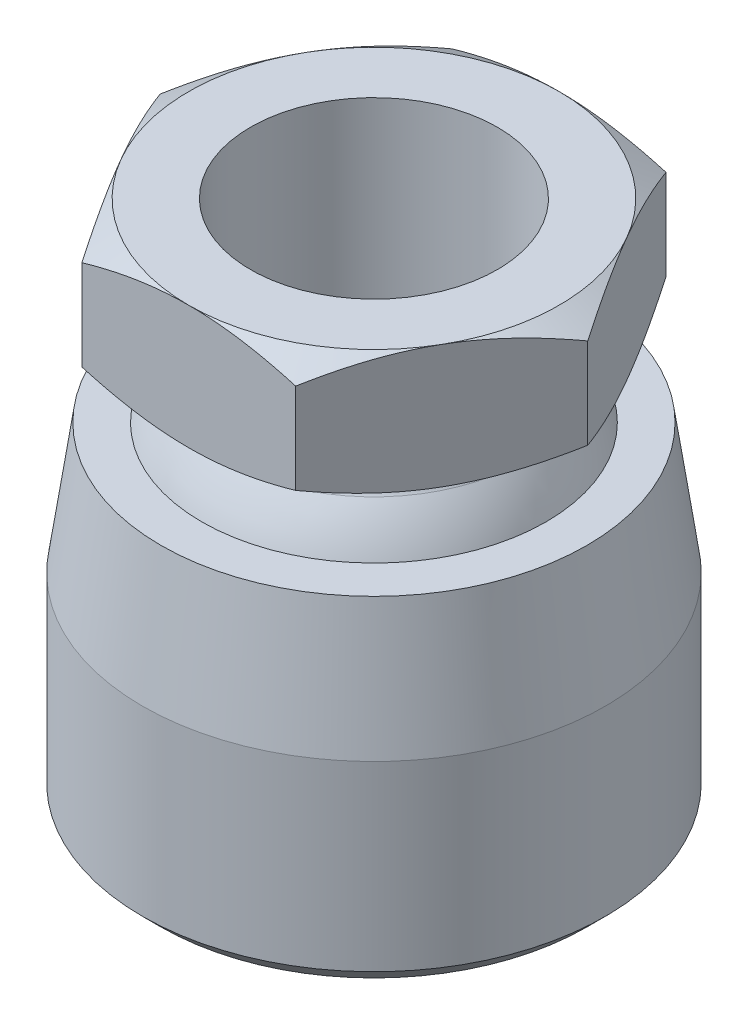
ISO-10303-21;
HEADER;
FILE_DESCRIPTION(('STEP AP214'),'2;1');
FILE_NAME('part.step','',(''),(''),'','','');
FILE_SCHEMA(('AUTOMOTIVE_DESIGN { 1 0 10303 214 1 1 1 1 }'));
ENDSEC;
DATA;
#1=APPLICATION_CONTEXT('core data for automotive mechanical design processes');
#2=APPLICATION_PROTOCOL_DEFINITION('international standard','automotive_design',2000,#1);
#3=PRODUCT_CONTEXT('',#1,'mechanical');
#4=PRODUCT('Part','Part','',(#3));
#5=PRODUCT_RELATED_PRODUCT_CATEGORY('part','',(#4));
#6=PRODUCT_DEFINITION_FORMATION('','',#4);
#7=PRODUCT_DEFINITION_CONTEXT('part definition',#1,'design');
#8=PRODUCT_DEFINITION('design','',#6,#7);
#9=PRODUCT_DEFINITION_SHAPE('','',#8);
#10=(LENGTH_UNIT() NAMED_UNIT(*) SI_UNIT(.MILLI.,.METRE.));
#11=(NAMED_UNIT(*) PLANE_ANGLE_UNIT() SI_UNIT($,.RADIAN.));
#12=(NAMED_UNIT(*) SI_UNIT($,.STERADIAN.) SOLID_ANGLE_UNIT());
#13=UNCERTAINTY_MEASURE_WITH_UNIT(LENGTH_MEASURE(1.E-05),#10,'distance_accuracy_value','');
#14=(GEOMETRIC_REPRESENTATION_CONTEXT(3) GLOBAL_UNCERTAINTY_ASSIGNED_CONTEXT((#13)) GLOBAL_UNIT_ASSIGNED_CONTEXT((#10,
#11,#12)) REPRESENTATION_CONTEXT('',''));
#15=CARTESIAN_POINT('',(0.,0.,0.));
#16=DIRECTION('',(0.,0.,1.));
#17=DIRECTION('',(1.,0.,0.));
#18=AXIS2_PLACEMENT_3D('',#15,#16,#17);
#19=CARTESIAN_POINT('',(0.,0.,0.));
#20=DIRECTION('',(-1.,0.,0.));
#21=DIRECTION('',(0.,1.,0.));
#22=AXIS2_PLACEMENT_3D('',#19,#20,#21);
#23=SPHERICAL_SURFACE('',#22,12.);
#24=CARTESIAN_POINT('',(0.,0.,0.));
#25=DIRECTION('',(0.,-1.,0.));
#26=DIRECTION('',(0.,0.,-1.));
#27=AXIS2_PLACEMENT_3D('',#24,#25,#26);
#28=SPHERICAL_SURFACE('',#27,12.);
#29=CARTESIAN_POINT('',(0.,7.09090909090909,0.));
#30=DIRECTION('',(0.,-1.,0.));
#31=DIRECTION('',(0.,0.,-1.));
#32=AXIS2_PLACEMENT_3D('',#29,#30,#31);
#33=CIRCLE('',#32,9.68085782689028);
#34=CARTESIAN_POINT('',(0.,7.09090909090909,-9.68085782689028));
#35=VERTEX_POINT('',#34);
#36=EDGE_CURVE('P0_E273',#35,#35,#33,.T.);
#37=ORIENTED_EDGE('',*,*,#36,.T.);
#38=EDGE_LOOP('',(#37));
#39=FACE_BOUND('',#38,.T.);
#40=ADVANCED_FACE('P0_F16',(#39),#28,.T.);
#41=CARTESIAN_POINT('',(-6.92820323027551,9.,12.));
#42=DIRECTION('',(0.,1.,0.));
#43=DIRECTION('',(0.,0.,1.));
#44=AXIS2_PLACEMENT_3D('',#41,#42,#43);
#45=PLANE('',#44);
#46=CARTESIAN_POINT('',(0.,9.,0.));
#47=DIRECTION('',(0.,1.,0.));
#48=DIRECTION('',(0.,0.,1.));
#49=AXIS2_PLACEMENT_3D('',#46,#47,#48);
#50=CIRCLE('',#49,10.6489436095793);
#51=CARTESIAN_POINT('',(0.,9.,10.6489436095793));
#52=VERTEX_POINT('',#51);
#53=EDGE_CURVE('P0_E270',#52,#52,#50,.T.);
#54=ORIENTED_EDGE('',*,*,#53,.T.);
#55=EDGE_LOOP('',(#54));
#56=FACE_BOUND('',#55,.T.);
#57=CARTESIAN_POINT('',(0.,9.,0.));
#58=DIRECTION('',(0.,1.,0.));
#59=DIRECTION('',(0.,0.,1.));
#60=AXIS2_PLACEMENT_3D('',#57,#58,#59);
#61=CIRCLE('',#60,12.);
#62=CARTESIAN_POINT('',(0.,9.,12.));
#63=VERTEX_POINT('',#62);
#64=CARTESIAN_POINT('',(10.3923048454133,9.,6.));
#65=VERTEX_POINT('',#64);
#66=EDGE_CURVE('P0_E317',#63,#65,#61,.T.);
#67=ORIENTED_EDGE('',*,*,#66,.F.);
#68=CARTESIAN_POINT('',(-10.3923048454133,9.,6.00000000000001));
#69=VERTEX_POINT('',#68);
#70=EDGE_CURVE('P0_E322',#69,#63,#61,.T.);
#71=ORIENTED_EDGE('',*,*,#70,.F.);
#72=CARTESIAN_POINT('',(-10.3923048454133,9.,-6.));
#73=VERTEX_POINT('',#72);
#74=EDGE_CURVE('P0_E318',#73,#69,#61,.T.);
#75=ORIENTED_EDGE('',*,*,#74,.F.);
#76=CARTESIAN_POINT('',(0.,9.,-12.));
#77=VERTEX_POINT('',#76);
#78=EDGE_CURVE('P0_E36',#77,#73,#61,.T.);
#79=ORIENTED_EDGE('',*,*,#78,.F.);
#80=CARTESIAN_POINT('',(10.3923048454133,9.,-6.));
#81=VERTEX_POINT('',#80);
#82=EDGE_CURVE('P0_E44',#81,#77,#61,.T.);
#83=ORIENTED_EDGE('',*,*,#82,.F.);
#84=EDGE_CURVE('P0_E314',#65,#81,#61,.T.);
#85=ORIENTED_EDGE('',*,*,#84,.F.);
#86=EDGE_LOOP('',(#67,#71,#75,#79,#83,#85));
#87=FACE_BOUND('',#86,.T.);
#88=ADVANCED_FACE('P0_F132',(#56,#87),#45,.F.);
#89=CARTESIAN_POINT('',(0.,7.8,0.));
#90=DIRECTION('',(0.,1.,0.));
#91=DIRECTION('',(0.,0.,1.));
#92=AXIS2_PLACEMENT_3D('',#89,#90,#91);
#93=TOROIDAL_SURFACE('',#92,10.6489436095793,1.2);
#94=ORIENTED_EDGE('',*,*,#36,.F.);
#95=EDGE_LOOP('',(#94));
#96=FACE_BOUND('',#95,.T.);
#97=ORIENTED_EDGE('',*,*,#53,.F.);
#98=EDGE_LOOP('',(#97));
#99=FACE_BOUND('',#98,.T.);
#100=ADVANCED_FACE('P0_F18',(#96,#99),#93,.F.);
#101=CARTESIAN_POINT('',(0.,9.,0.));
#102=DIRECTION('',(0.,1.,0.));
#103=DIRECTION('',(0.,0.,1.));
#104=AXIS2_PLACEMENT_3D('',#101,#102,#103);
#105=CONICAL_SURFACE('',#104,12.,1.0471975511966);
#106=CARTESIAN_POINT('',(-6.92808776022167,10.0718634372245,12.0002));
#107=CARTESIAN_POINT('',(-7.08038456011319,9.98394963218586,11.7364142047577));
#108=CARTESIAN_POINT('',(-7.23324920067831,9.90002599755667,11.4716448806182));
#109=CARTESIAN_POINT('',(-7.54020434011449,9.74126621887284,10.9399829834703));
#110=CARTESIAN_POINT('',(-7.69429522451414,9.66643306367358,10.6730897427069));
#111=CARTESIAN_POINT('',(-8.15905073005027,9.45701753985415,9.86810959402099));
#112=CARTESIAN_POINT('',(-8.47155003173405,9.33790323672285,9.3268449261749));
#113=CARTESIAN_POINT('',(-8.93919090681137,9.19823106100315,8.516867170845));
#114=CARTESIAN_POINT('',(-9.09293539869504,9.15844379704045,8.25057389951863));
#115=CARTESIAN_POINT('',(-9.40113622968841,9.09172336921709,7.71675440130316));
#116=CARTESIAN_POINT('',(-9.55559258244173,9.06479045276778,7.44922815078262));
#117=CARTESIAN_POINT('',(-9.86476279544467,9.02446859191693,6.91372963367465));
#118=CARTESIAN_POINT('',(-10.0194761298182,9.01106355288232,6.64575827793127));
#119=CARTESIAN_POINT('',(-10.3290461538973,8.99808309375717,6.10956726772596));
#120=CARTESIAN_POINT('',(-10.4839028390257,8.99850724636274,5.84134762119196));
#121=CARTESIAN_POINT('',(-10.7734076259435,9.01222001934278,5.33991062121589));
#122=CARTESIAN_POINT('',(-10.908076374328,9.02383598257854,5.10665750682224));
#123=CARTESIAN_POINT('',(-11.1771041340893,9.05730800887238,4.64068775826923));
#124=CARTESIAN_POINT('',(-11.3114631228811,9.07916479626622,4.40797116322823));
#125=CARTESIAN_POINT('',(-11.5797983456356,9.13273741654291,3.94320092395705));
#126=CARTESIAN_POINT('',(-11.7137741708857,9.16446139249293,3.711147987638));
#127=CARTESIAN_POINT('',(-11.9810977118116,9.23721177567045,3.24813003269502));
#128=CARTESIAN_POINT('',(-12.1144453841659,9.2782388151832,3.01716508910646));
#129=CARTESIAN_POINT('',(-12.5192297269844,9.41631165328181,2.31605804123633));
#130=CARTESIAN_POINT('',(-12.789494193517,9.52712488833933,1.84794625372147));
#131=CARTESIAN_POINT('',(-13.3259930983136,9.77862576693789,0.918702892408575));
#132=CARTESIAN_POINT('',(-13.5922344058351,9.91925434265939,0.457559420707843));
#133=CARTESIAN_POINT('',(-13.8565219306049,10.0718634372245,-0.000200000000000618));
#134=B_SPLINE_CURVE_WITH_KNOTS('',3,(#106,#107,#108,#109,#110,#111,#112,#113,#114,#115,#116,
#117,#118,#119,#120,#121,#122,#123,#124,#125,#126,#127,#128,#129,#130,#131,#132,#133),
.UNSPECIFIED.,.F.,.F.,(4,2,2,2,2,2,2,2,2,2,2,2,2,4),(0.,0.951004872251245,1.90232158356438,
3.80900466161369,4.7389455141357,5.66890426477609,6.59775529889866,7.5265776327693,
8.33514643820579,9.14377244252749,9.95306755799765,10.7624176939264,12.4167102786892,
14.0677556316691),.UNSPECIFIED.);
#135=CARTESIAN_POINT('',(-6.92820323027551,10.0717967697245,12.));
#136=VERTEX_POINT('',#135);
#137=EDGE_CURVE('P0_E167',#136,#69,#134,.T.);
#138=ORIENTED_EDGE('',*,*,#137,.T.);
#139=ORIENTED_EDGE('',*,*,#70,.T.);
#140=CARTESIAN_POINT('',(-18.7838793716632,14.9408050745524,12.));
#141=CARTESIAN_POINT('',(-18.5210939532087,14.8129518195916,12.));
#142=CARTESIAN_POINT('',(-18.2580048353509,14.6857230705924,12.));
#143=CARTESIAN_POINT('',(-17.731155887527,14.4326556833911,12.));
#144=CARTESIAN_POINT('',(-17.4673960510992,14.3068170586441,12.));
#145=CARTESIAN_POINT('',(-16.6749476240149,13.9315659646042,12.));
#146=CARTESIAN_POINT('',(-16.1451651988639,13.6844549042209,12.));
#147=CARTESIAN_POINT('',(-15.0793119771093,13.1965378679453,12.));
#148=CARTESIAN_POINT('',(-14.5432227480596,12.955772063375,12.));
#149=CARTESIAN_POINT('',(-13.466841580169,12.4838594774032,12.));
#150=CARTESIAN_POINT('',(-12.926549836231,12.2527122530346,12.));
#151=CARTESIAN_POINT('',(-11.8227807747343,11.7950617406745,12.));
#152=CARTESIAN_POINT('',(-11.2591315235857,11.5689710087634,12.));
#153=CARTESIAN_POINT('',(-10.1252992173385,11.133482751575,12.));
#154=CARTESIAN_POINT('',(-9.55511544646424,10.9240870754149,12.));
#155=CARTESIAN_POINT('',(-8.40833746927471,10.5273624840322,12.));
#156=CARTESIAN_POINT('',(-7.8317583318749,10.3399903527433,12.));
#157=CARTESIAN_POINT('',(-6.67027666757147,9.99319880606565,12.));
#158=CARTESIAN_POINT('',(-6.08537676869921,9.83377076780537,12.));
#159=CARTESIAN_POINT('',(-5.20330441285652,9.62170933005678,12.));
#160=CARTESIAN_POINT('',(-4.90933298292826,9.55568479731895,12.));
#161=CARTESIAN_POINT('',(-4.31934980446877,9.43343091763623,12.));
#162=CARTESIAN_POINT('',(-4.02333809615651,9.37720137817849,12.));
#163=CARTESIAN_POINT('',(-3.42946585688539,9.27551902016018,12.));
#164=CARTESIAN_POINT('',(-3.13160536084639,9.23006599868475,12.));
#165=CARTESIAN_POINT('',(-2.53433668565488,9.15083650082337,12.));
#166=CARTESIAN_POINT('',(-2.23492856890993,9.11705955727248,12.));
#167=CARTESIAN_POINT('',(-1.63896759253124,9.06228660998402,12.));
#168=CARTESIAN_POINT('',(-1.34242994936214,9.04112606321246,12.));
#169=CARTESIAN_POINT('',(-0.748725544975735,9.01137267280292,12.));
#170=CARTESIAN_POINT('',(-0.451558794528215,9.00277961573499,12.));
#171=CARTESIAN_POINT('',(0.142871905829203,8.99836646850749,12.));
#172=CARTESIAN_POINT('',(0.440135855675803,9.00254637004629,12.));
#173=CARTESIAN_POINT('',(1.03421852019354,9.0235748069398,12.));
#174=CARTESIAN_POINT('',(1.33103721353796,9.04042393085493,12.));
#175=CARTESIAN_POINT('',(2.03918980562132,9.09537508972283,12.));
#176=CARTESIAN_POINT('',(2.45008953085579,9.13919946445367,12.));
#177=CARTESIAN_POINT('',(3.26893309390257,9.24877565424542,12.));
#178=CARTESIAN_POINT('',(3.67687654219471,9.31453030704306,12.));
#179=CARTESIAN_POINT('',(4.89575489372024,9.54121104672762,12.));
#180=CARTESIAN_POINT('',(5.70130370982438,9.73151567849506,12.));
#181=CARTESIAN_POINT('',(6.9060193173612,10.0627179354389,12.));
#182=CARTESIAN_POINT('',(7.31140327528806,10.1823127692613,12.));
#183=CARTESIAN_POINT('',(8.1182371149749,10.4342262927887,12.));
#184=CARTESIAN_POINT('',(8.51968696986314,10.5665450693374,12.));
#185=CARTESIAN_POINT('',(9.31877265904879,10.8417585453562,12.));
#186=CARTESIAN_POINT('',(9.7164096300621,10.9846499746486,12.));
#187=CARTESIAN_POINT('',(10.5083692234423,11.2792974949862,12.));
#188=CARTESIAN_POINT('',(10.9026918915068,11.4310534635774,12.));
#189=CARTESIAN_POINT('',(11.8588048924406,11.8093998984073,12.));
#190=CARTESIAN_POINT('',(12.4190462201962,12.0398984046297,12.));
#191=CARTESIAN_POINT('',(13.5345226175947,12.5127432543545,12.));
#192=CARTESIAN_POINT('',(14.0897573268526,12.7550904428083,12.));
#193=CARTESIAN_POINT('',(15.1961936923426,13.249174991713,12.));
#194=CARTESIAN_POINT('',(15.7473942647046,13.5009147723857,12.));
#195=CARTESIAN_POINT('',(16.8463177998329,14.0118184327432,12.));
#196=CARTESIAN_POINT('',(17.3940408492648,14.2709821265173,12.));
#197=CARTESIAN_POINT('',(18.4872735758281,14.7956176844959,12.));
#198=CARTESIAN_POINT('',(19.0327797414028,15.0610968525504,12.));
#199=CARTESIAN_POINT('',(20.1213831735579,15.5969485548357,12.));
#200=CARTESIAN_POINT('',(20.6644804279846,15.8673211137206,12.));
#201=CARTESIAN_POINT('',(21.7485674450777,16.4120540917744,12.));
#202=CARTESIAN_POINT('',(22.2895575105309,16.6864139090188,12.));
#203=CARTESIAN_POINT('',(23.3698239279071,17.2384887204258,12.));
#204=CARTESIAN_POINT('',(23.9091002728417,17.5162037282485,12.));
#205=CARTESIAN_POINT('',(25.4294364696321,18.3041555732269,12.));
#206=CARTESIAN_POINT('',(26.4088082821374,18.817649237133,12.));
#207=CARTESIAN_POINT('',(28.3639355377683,19.8515554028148,12.));
#208=CARTESIAN_POINT('',(29.3396908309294,20.3719681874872,12.));
#209=CARTESIAN_POINT('',(31.2857136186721,21.4166323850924,12.));
#210=CARTESIAN_POINT('',(32.255988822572,21.9408694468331,12.));
#211=CARTESIAN_POINT('',(33.709708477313,22.7302695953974,12.));
#212=CARTESIAN_POINT('',(34.1939850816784,22.9939024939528,12.));
#213=CARTESIAN_POINT('',(35.1620396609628,23.5220805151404,12.));
#214=CARTESIAN_POINT('',(35.64581763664,23.7866256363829,12.));
#215=CARTESIAN_POINT('',(36.1293750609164,24.0515734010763,12.));
#216=B_SPLINE_CURVE_WITH_KNOTS('',3,(#140,#141,#142,#143,#144,#145,#146,#147,#148,#149,#150,
#151,#152,#153,#154,#155,#156,#157,#158,#159,#160,#161,#162,#163,#164,#165,#166,#167,#168,#169,
#170,#171,#172,#173,#174,#175,#176,#177,#178,#179,#180,#181,#182,#183,#184,#185,#186,#187,#188,
#189,#190,#191,#192,#193,#194,#195,#196,#197,#198,#199,#200,#201,#202,#203,#204,#205,#206,#207,
#208,#209,#210,#211,#212,#213,#214,#215),.UNSPECIFIED.,.F.,.F.,(4,2,2,2,2,2,2,2,2,2,2,2,2,2,2,2,
2,2,2,2,2,2,2,2,2,2,2,2,2,2,2,2,2,2,2,2,2,4),(0.,0.876710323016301,1.75342912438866,
3.50711733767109,5.27006333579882,7.03292805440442,8.85463646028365,10.6765463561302,
12.4948192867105,14.3125301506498,15.2162772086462,16.1200065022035,17.0237187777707,
17.9273948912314,18.819011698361,19.7106133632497,20.602214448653,21.4938569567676,
22.7328508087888,23.9720050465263,26.4516149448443,27.7194761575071,28.9873460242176,
30.2548253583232,31.5222871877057,33.3395149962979,35.1568725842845,36.9747017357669,
38.7924854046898,40.6124847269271,42.432493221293,44.2522297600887,46.071973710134,
49.3894010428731,52.7069644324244,56.0154742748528,57.6696305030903,59.3237842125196),.UNSPECIFIED.);
#217=EDGE_CURVE('P0_E20',#63,#136,#216,.F.);
#218=ORIENTED_EDGE('',*,*,#217,.T.);
#219=EDGE_LOOP('',(#138,#139,#218));
#220=FACE_BOUND('',#219,.T.);
#221=ADVANCED_FACE('P0_F181',(#220),#105,.T.);
#222=CARTESIAN_POINT('',(13.8565219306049,10.0718634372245,-0.000199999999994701));
#223=CARTESIAN_POINT('',(13.7042251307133,9.98394963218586,0.263585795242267));
#224=CARTESIAN_POINT('',(13.5513604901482,9.90002599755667,0.528355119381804));
#225=CARTESIAN_POINT('',(13.244405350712,9.74126621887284,1.06001701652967));
#226=CARTESIAN_POINT('',(13.0903144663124,9.66643306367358,1.32691025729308));
#227=CARTESIAN_POINT('',(12.6255589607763,9.45701753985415,2.13189040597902));
#228=CARTESIAN_POINT('',(12.3130596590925,9.33790323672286,2.67315507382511));
#229=CARTESIAN_POINT('',(11.8454187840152,9.19823106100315,3.483132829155));
#230=CARTESIAN_POINT('',(11.6916742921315,9.15844379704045,3.74942610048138));
#231=CARTESIAN_POINT('',(11.3834734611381,9.09172336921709,4.28324559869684));
#232=CARTESIAN_POINT('',(11.2290171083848,9.06479045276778,4.55077184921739));
#233=CARTESIAN_POINT('',(10.9198468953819,9.02446859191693,5.08627036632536));
#234=CARTESIAN_POINT('',(10.7651335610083,9.01106355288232,5.35424172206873));
#235=CARTESIAN_POINT('',(10.4555635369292,8.99808309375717,5.89043273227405));
#236=CARTESIAN_POINT('',(10.3007068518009,8.99850724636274,6.15865237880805));
#237=CARTESIAN_POINT('',(10.011202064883,9.01222001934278,6.66008937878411));
#238=CARTESIAN_POINT('',(9.87653331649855,9.02383598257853,6.89334249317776));
#239=CARTESIAN_POINT('',(9.60750555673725,9.05730800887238,7.35931224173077));
#240=CARTESIAN_POINT('',(9.47314656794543,9.07916479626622,7.59202883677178));
#241=CARTESIAN_POINT('',(9.20481134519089,9.13273741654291,8.05679907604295));
#242=CARTESIAN_POINT('',(9.07083551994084,9.16446139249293,8.28885201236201));
#243=CARTESIAN_POINT('',(8.80351197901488,9.23721177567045,8.75186996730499));
#244=CARTESIAN_POINT('',(8.67016430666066,9.2782388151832,8.98283491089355));
#245=CARTESIAN_POINT('',(8.2653799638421,9.41631165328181,9.68394195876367));
#246=CARTESIAN_POINT('',(7.99511549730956,9.52712488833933,10.1520537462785));
#247=CARTESIAN_POINT('',(7.45861659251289,9.77862576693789,11.0812971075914));
#248=CARTESIAN_POINT('',(7.19237528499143,9.91925434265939,11.5424405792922));
#249=CARTESIAN_POINT('',(6.92808776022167,10.0718634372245,12.0002));
#250=B_SPLINE_CURVE_WITH_KNOTS('',3,(#222,#223,#224,#225,#226,#227,#228,#229,#230,#231,#232,
#233,#234,#235,#236,#237,#238,#239,#240,#241,#242,#243,#244,#245,#246,#247,#248,#249),
.UNSPECIFIED.,.F.,.F.,(4,2,2,2,2,2,2,2,2,2,2,2,2,4),(0.,0.951004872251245,1.90232158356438,
3.80900466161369,4.7389455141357,5.66890426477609,6.59775529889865,7.5265776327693,
8.33514643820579,9.14377244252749,9.95306755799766,10.7624176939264,12.4167102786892,
14.0677556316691),.UNSPECIFIED.);
#251=CARTESIAN_POINT('',(6.92820323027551,10.0717967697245,12.));
#252=VERTEX_POINT('',#251);
#253=EDGE_CURVE('P0_E189',#65,#252,#250,.T.);
#254=ORIENTED_EDGE('',*,*,#253,.T.);
#255=EDGE_CURVE('P0_E11',#252,#63,#216,.F.);
#256=ORIENTED_EDGE('',*,*,#255,.T.);
#257=ORIENTED_EDGE('',*,*,#66,.T.);
#258=EDGE_LOOP('',(#254,#256,#257));
#259=FACE_BOUND('',#258,.T.);
#260=ADVANCED_FACE('P0_F177',(#259),#105,.T.);
#261=CARTESIAN_POINT('',(6.92808776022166,10.0718634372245,-12.0002));
#262=CARTESIAN_POINT('',(7.08038456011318,9.98394963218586,-11.7364142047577));
#263=CARTESIAN_POINT('',(7.2332492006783,9.90002599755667,-11.4716448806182));
#264=CARTESIAN_POINT('',(7.54020434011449,9.74126621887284,-10.9399829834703));
#265=CARTESIAN_POINT('',(7.69429522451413,9.66643306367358,-10.6730897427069));
#266=CARTESIAN_POINT('',(8.15905073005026,9.45701753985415,-9.86810959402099));
#267=CARTESIAN_POINT('',(8.47155003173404,9.33790323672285,-9.3268449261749));
#268=CARTESIAN_POINT('',(8.93919090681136,9.19823106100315,-8.516867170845));
#269=CARTESIAN_POINT('',(9.09293539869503,9.15844379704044,-8.25057389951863));
#270=CARTESIAN_POINT('',(9.4011362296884,9.09172336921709,-7.71675440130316));
#271=CARTESIAN_POINT('',(9.55559258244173,9.06479045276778,-7.44922815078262));
#272=CARTESIAN_POINT('',(9.86476279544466,9.02446859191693,-6.91372963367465));
#273=CARTESIAN_POINT('',(10.0194761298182,9.01106355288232,-6.64575827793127));
#274=CARTESIAN_POINT('',(10.3290461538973,8.99808309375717,-6.10956726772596));
#275=CARTESIAN_POINT('',(10.4839028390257,8.99850724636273,-5.84134762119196));
#276=CARTESIAN_POINT('',(10.7734076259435,9.01222001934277,-5.33991062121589));
#277=CARTESIAN_POINT('',(10.908076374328,9.02383598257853,-5.10665750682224));
#278=CARTESIAN_POINT('',(11.1771041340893,9.05730800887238,-4.64068775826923));
#279=CARTESIAN_POINT('',(11.3114631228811,9.07916479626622,-4.40797116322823));
#280=CARTESIAN_POINT('',(11.5797983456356,9.13273741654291,-3.94320092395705));
#281=CARTESIAN_POINT('',(11.7137741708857,9.16446139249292,-3.711147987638));
#282=CARTESIAN_POINT('',(11.9810977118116,9.23721177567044,-3.24813003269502));
#283=CARTESIAN_POINT('',(12.1144453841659,9.2782388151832,-3.01716508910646));
#284=CARTESIAN_POINT('',(12.5192297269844,9.41631165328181,-2.31605804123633));
#285=CARTESIAN_POINT('',(12.789494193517,9.52712488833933,-1.84794625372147));
#286=CARTESIAN_POINT('',(13.3259930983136,9.77862576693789,-0.918702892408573));
#287=CARTESIAN_POINT('',(13.5922344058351,9.91925434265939,-0.45755942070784));
#288=CARTESIAN_POINT('',(13.8565219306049,10.0718634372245,0.000200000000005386));
#289=B_SPLINE_CURVE_WITH_KNOTS('',3,(#261,#262,#263,#264,#265,#266,#267,#268,#269,#270,#271,
#272,#273,#274,#275,#276,#277,#278,#279,#280,#281,#282,#283,#284,#285,#286,#287,#288),
.UNSPECIFIED.,.F.,.F.,(4,2,2,2,2,2,2,2,2,2,2,2,2,4),(0.,0.951004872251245,1.90232158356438,
3.80900466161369,4.7389455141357,5.66890426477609,6.59775529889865,7.5265776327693,
8.33514643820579,9.14377244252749,9.95306755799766,10.7624176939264,12.4167102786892,
14.0677556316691),.UNSPECIFIED.);
#290=CARTESIAN_POINT('',(13.856406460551,10.0717967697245,0.));
#291=VERTEX_POINT('',#290);
#292=EDGE_CURVE('P0_E196',#81,#291,#289,.T.);
#293=ORIENTED_EDGE('',*,*,#292,.T.);
#294=EDGE_CURVE('P0_E304',#291,#65,#250,.T.);
#295=ORIENTED_EDGE('',*,*,#294,.T.);
#296=ORIENTED_EDGE('',*,*,#84,.T.);
#297=EDGE_LOOP('',(#293,#295,#296));
#298=FACE_BOUND('',#297,.T.);
#299=ADVANCED_FACE('P0_F180',(#298),#105,.T.);
#300=CARTESIAN_POINT('',(-18.7838793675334,14.9408050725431,-12.));
#301=CARTESIAN_POINT('',(-18.5210939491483,14.8129518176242,-12.));
#302=CARTESIAN_POINT('',(-18.25800483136,14.6857230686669,-12.));
#303=CARTESIAN_POINT('',(-17.731155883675,14.4326556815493,-12.));
#304=CARTESIAN_POINT('',(-17.4673960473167,14.3068170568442,-12.));
#305=CARTESIAN_POINT('',(-16.6749476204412,13.9315659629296,-12.));
#306=CARTESIAN_POINT('',(-16.1451651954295,13.6844549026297,-12.));
#307=CARTESIAN_POINT('',(-15.0793119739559,13.196537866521,-12.));
#308=CARTESIAN_POINT('',(-14.5432227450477,12.955772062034,-12.));
#309=CARTESIAN_POINT('',(-13.4668415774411,12.4838594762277,-12.));
#310=CARTESIAN_POINT('',(-12.9265498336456,12.2527122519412,-12.));
#311=CARTESIAN_POINT('',(-11.8227807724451,11.7950617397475,-12.));
#312=CARTESIAN_POINT('',(-11.2591315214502,11.5689710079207,-12.));
#313=CARTESIAN_POINT('',(-10.1252992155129,11.1334827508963,-12.));
#314=CARTESIAN_POINT('',(-9.55511544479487,10.924087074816,-12.));
#315=CARTESIAN_POINT('',(-8.40833746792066,10.5273624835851,-12.));
#316=CARTESIAN_POINT('',(-7.83175833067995,10.3399903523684,-12.));
#317=CARTESIAN_POINT('',(-6.67027666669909,9.99319880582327,-12.));
#318=CARTESIAN_POINT('',(-6.08537676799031,9.83377076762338,-12.));
#319=CARTESIAN_POINT('',(-5.20330441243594,9.62170932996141,-12.));
#320=CARTESIAN_POINT('',(-4.90933298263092,9.55568479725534,-12.));
#321=CARTESIAN_POINT('',(-4.31934980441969,9.43343091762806,-12.));
#322=CARTESIAN_POINT('',(-4.02333809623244,9.377201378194,-12.));
#323=CARTESIAN_POINT('',(-3.4294658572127,9.27551902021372,-12.));
#324=CARTESIAN_POINT('',(-3.13160536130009,9.23006599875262,-12.));
#325=CARTESIAN_POINT('',(-2.53433668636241,9.15083650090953,-12.));
#326=CARTESIAN_POINT('',(-2.23492856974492,9.11705955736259,-12.));
#327=CARTESIAN_POINT('',(-1.63896759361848,9.06228661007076,-12.));
#328=CARTESIAN_POINT('',(-1.34242995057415,9.04112606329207,-12.));
#329=CARTESIAN_POINT('',(-0.748725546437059,9.01137267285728,-12.));
#330=CARTESIAN_POINT('',(-0.45155879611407,9.00277961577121,-12.));
#331=CARTESIAN_POINT('',(0.142871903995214,8.99836646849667,-12.));
#332=CARTESIAN_POINT('',(0.440135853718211,9.00254637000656,-12.));
#333=CARTESIAN_POINT('',(1.03421851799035,9.02357480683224,-12.));
#334=CARTESIAN_POINT('',(1.33103721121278,9.04042393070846,-12.));
#335=CARTESIAN_POINT('',(2.03918980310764,9.09537508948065,-12.));
#336=CARTESIAN_POINT('',(2.45008952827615,9.13919946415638,-12.));
#337=CARTESIAN_POINT('',(3.26893309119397,9.24877565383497,-12.));
#338=CARTESIAN_POINT('',(3.67687653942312,9.31453030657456,-12.));
#339=CARTESIAN_POINT('',(4.89575489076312,9.54121104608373,-12.));
#340=CARTESIAN_POINT('',(5.70130370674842,9.73151567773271,-12.));
#341=CARTESIAN_POINT('',(6.90601931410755,10.0627179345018,-12.));
#342=CARTESIAN_POINT('',(7.31140327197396,10.1823127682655,-12.));
#343=CARTESIAN_POINT('',(8.11823711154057,10.4342262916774,-12.));
#344=CARTESIAN_POINT('',(8.51968696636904,10.5665450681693,-12.));
#345=CARTESIAN_POINT('',(9.31877265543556,10.8417585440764,-12.));
#346=CARTESIAN_POINT('',(9.71640962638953,10.984649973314,-12.));
#347=CARTESIAN_POINT('',(10.5083692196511,11.2792974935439,-12.));
#348=CARTESIAN_POINT('',(10.9026918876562,11.4310534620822,-12.));
#349=CARTESIAN_POINT('',(11.8588048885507,11.8093998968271,-12.));
#350=CARTESIAN_POINT('',(12.4190462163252,12.0398984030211,-12.));
#351=CARTESIAN_POINT('',(13.5345226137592,12.5127432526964,-12.));
#352=CARTESIAN_POINT('',(14.0897573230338,12.7550904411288,-12.));
#353=CARTESIAN_POINT('',(15.1961936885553,13.249174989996,-12.));
#354=CARTESIAN_POINT('',(15.7473942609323,13.5009147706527,-12.));
#355=CARTESIAN_POINT('',(16.8463177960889,14.0118184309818,-12.));
#356=CARTESIAN_POINT('',(17.3940408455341,14.2709821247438,-12.));
#357=CARTESIAN_POINT('',(18.4872735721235,14.7956176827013,-12.));
#358=CARTESIAN_POINT('',(19.032779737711,15.0610968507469,-12.));
#359=CARTESIAN_POINT('',(20.1213831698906,15.5969485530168,-12.));
#360=CARTESIAN_POINT('',(20.664480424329,15.8673211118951,-12.));
#361=CARTESIAN_POINT('',(21.7485674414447,16.4120540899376,-12.));
#362=CARTESIAN_POINT('',(22.2895575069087,16.6864139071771,-12.));
#363=CARTESIAN_POINT('',(23.3698239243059,17.2384887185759,-12.));
#364=CARTESIAN_POINT('',(23.9091002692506,17.5162037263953,-12.));
#365=CARTESIAN_POINT('',(25.4294364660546,18.3041555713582,-12.));
#366=CARTESIAN_POINT('',(26.4088082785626,18.8176492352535,-12.));
#367=CARTESIAN_POINT('',(28.363935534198,19.8515554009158,-12.));
#368=CARTESIAN_POINT('',(29.3396908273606,20.3719681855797,-12.));
#369=CARTESIAN_POINT('',(31.2857136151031,21.4166323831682,-12.));
#370=CARTESIAN_POINT('',(32.2559888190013,21.9408694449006,-12.));
#371=CARTESIAN_POINT('',(33.709708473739,22.7302695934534,-12.));
#372=CARTESIAN_POINT('',(34.1939850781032,22.993902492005,-12.));
#373=CARTESIAN_POINT('',(35.1620396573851,23.5220805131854,-12.));
#374=CARTESIAN_POINT('',(35.645817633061,23.7866256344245,-12.));
#375=CARTESIAN_POINT('',(36.129375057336,24.0515733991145,-12.));
#376=B_SPLINE_CURVE_WITH_KNOTS('',3,(#300,#301,#302,#303,#304,#305,#306,#307,#308,#309,#310,
#311,#312,#313,#314,#315,#316,#317,#318,#319,#320,#321,#322,#323,#324,#325,#326,#327,#328,#329,
#330,#331,#332,#333,#334,#335,#336,#337,#338,#339,#340,#341,#342,#343,#344,#345,#346,#347,#348,
#349,#350,#351,#352,#353,#354,#355,#356,#357,#358,#359,#360,#361,#362,#363,#364,#365,#366,#367,
#368,#369,#370,#371,#372,#373,#374,#375),.UNSPECIFIED.,.F.,.F.,(4,2,2,2,2,2,2,2,2,2,2,2,2,2,2,2,
2,2,2,2,2,2,2,2,2,2,2,2,2,2,2,2,2,2,2,2,2,4),(0.,0.876710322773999,1.75342912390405,
3.50711733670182,5.27006333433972,7.03292805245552,8.85463645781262,10.6765463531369,
12.4948192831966,14.3125301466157,15.2162772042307,16.1200064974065,17.0237187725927,
17.9273948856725,18.8190116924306,19.7106133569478,20.6022144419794,21.4938569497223,
22.7328508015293,23.9720050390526,26.4516149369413,27.7194761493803,28.987346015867,
30.2548253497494,31.5222871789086,33.3395149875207,35.1568725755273,36.9747017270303,
38.7924853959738,40.6124847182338,42.4324932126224,44.2522297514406,46.0719737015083,
49.3894010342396,52.7069644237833,56.0154742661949,57.669630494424,59.3237842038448),.UNSPECIFIED.);
#377=CARTESIAN_POINT('',(6.9282032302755,10.0717967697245,-12.));
#378=VERTEX_POINT('',#377);
#379=EDGE_CURVE('P0_E201',#77,#378,#376,.T.);
#380=ORIENTED_EDGE('',*,*,#379,.T.);
#381=EDGE_CURVE('P0_E207',#378,#81,#289,.T.);
#382=ORIENTED_EDGE('',*,*,#381,.T.);
#383=ORIENTED_EDGE('',*,*,#82,.T.);
#384=EDGE_LOOP('',(#380,#382,#383));
#385=FACE_BOUND('',#384,.T.);
#386=ADVANCED_FACE('P0_F310',(#385),#105,.T.);
#387=CARTESIAN_POINT('',(-13.8565219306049,10.0718634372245,0.000199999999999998));
#388=CARTESIAN_POINT('',(-13.7042251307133,9.98394963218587,-0.263585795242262));
#389=CARTESIAN_POINT('',(-13.5513604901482,9.90002599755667,-0.5283551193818));
#390=CARTESIAN_POINT('',(-13.244405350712,9.74126621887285,-1.06001701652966));
#391=CARTESIAN_POINT('',(-13.0903144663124,9.66643306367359,-1.32691025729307));
#392=CARTESIAN_POINT('',(-12.6255589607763,9.45701753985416,-2.13189040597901));
#393=CARTESIAN_POINT('',(-12.3130596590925,9.33790323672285,-2.6731550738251));
#394=CARTESIAN_POINT('',(-11.8454187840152,9.19823106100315,-3.483132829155));
#395=CARTESIAN_POINT('',(-11.6916742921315,9.15844379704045,-3.74942610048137));
#396=CARTESIAN_POINT('',(-11.3834734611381,9.09172336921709,-4.28324559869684));
#397=CARTESIAN_POINT('',(-11.2290171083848,9.06479045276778,-4.55077184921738));
#398=CARTESIAN_POINT('',(-10.9198468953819,9.02446859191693,-5.08627036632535));
#399=CARTESIAN_POINT('',(-10.7651335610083,9.01106355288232,-5.35424172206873));
#400=CARTESIAN_POINT('',(-10.4555635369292,8.99808309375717,-5.89043273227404));
#401=CARTESIAN_POINT('',(-10.3007068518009,8.99850724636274,-6.15865237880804));
#402=CARTESIAN_POINT('',(-10.011202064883,9.01222001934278,-6.66008937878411));
#403=CARTESIAN_POINT('',(-9.87653331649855,9.02383598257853,-6.89334249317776));
#404=CARTESIAN_POINT('',(-9.60750555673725,9.05730800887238,-7.35931224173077));
#405=CARTESIAN_POINT('',(-9.47314656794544,9.07916479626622,-7.59202883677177));
#406=CARTESIAN_POINT('',(-9.2048113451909,9.13273741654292,-8.05679907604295));
#407=CARTESIAN_POINT('',(-9.07083551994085,9.16446139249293,-8.28885201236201));
#408=CARTESIAN_POINT('',(-8.80351197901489,9.23721177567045,-8.75186996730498));
#409=CARTESIAN_POINT('',(-8.67016430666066,9.2782388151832,-8.98283491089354));
#410=CARTESIAN_POINT('',(-8.2653799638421,9.41631165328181,-9.68394195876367));
#411=CARTESIAN_POINT('',(-7.99511549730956,9.52712488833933,-10.1520537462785));
#412=CARTESIAN_POINT('',(-7.45861659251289,9.77862576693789,-11.0812971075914));
#413=CARTESIAN_POINT('',(-7.19237528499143,9.91925434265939,-11.5424405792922));
#414=CARTESIAN_POINT('',(-6.92808776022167,10.0718634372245,-12.0002));
#415=B_SPLINE_CURVE_WITH_KNOTS('',3,(#387,#388,#389,#390,#391,#392,#393,#394,#395,#396,#397,
#398,#399,#400,#401,#402,#403,#404,#405,#406,#407,#408,#409,#410,#411,#412,#413,#414),
.UNSPECIFIED.,.F.,.F.,(4,2,2,2,2,2,2,2,2,2,2,2,2,4),(0.,0.951004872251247,1.90232158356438,
3.80900466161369,4.7389455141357,5.6689042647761,6.59775529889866,7.52657763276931,
8.33514643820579,9.1437724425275,9.95306755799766,10.7624176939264,12.4167102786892,
14.0677556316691),.UNSPECIFIED.);
#416=CARTESIAN_POINT('',(-6.92820323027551,10.0717967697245,-12.));
#417=VERTEX_POINT('',#416);
#418=EDGE_CURVE('P0_E169',#73,#417,#415,.T.);
#419=ORIENTED_EDGE('',*,*,#418,.T.);
#420=EDGE_CURVE('P0_E206',#417,#77,#376,.T.);
#421=ORIENTED_EDGE('',*,*,#420,.T.);
#422=ORIENTED_EDGE('',*,*,#78,.T.);
#423=EDGE_LOOP('',(#419,#421,#422));
#424=FACE_BOUND('',#423,.T.);
#425=ADVANCED_FACE('P0_F437',(#424),#105,.T.);
#426=CARTESIAN_POINT('',(-13.856406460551,10.0717967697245,0.));
#427=VERTEX_POINT('',#426);
#428=EDGE_CURVE('P0_E161',#69,#427,#134,.T.);
#429=ORIENTED_EDGE('',*,*,#428,.T.);
#430=EDGE_CURVE('P0_E168',#427,#73,#415,.T.);
#431=ORIENTED_EDGE('',*,*,#430,.T.);
#432=ORIENTED_EDGE('',*,*,#74,.T.);
#433=EDGE_LOOP('',(#429,#431,#432));
#434=FACE_BOUND('',#433,.T.);
#435=ADVANCED_FACE('P0_F341',(#434),#105,.T.);
#436=CARTESIAN_POINT('',(-6.92820323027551,9.,12.));
#437=DIRECTION('',(0.,0.,1.));
#438=DIRECTION('',(1.,0.,0.));
#439=AXIS2_PLACEMENT_3D('',#436,#437,#438);
#440=PLANE('',#439);
#441=CARTESIAN_POINT('',(-18.7838793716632,11.0591949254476,12.));
#442=CARTESIAN_POINT('',(-18.5210939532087,11.1870481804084,12.));
#443=CARTESIAN_POINT('',(-18.2580048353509,11.3142769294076,12.));
#444=CARTESIAN_POINT('',(-17.731155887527,11.5673443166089,12.));
#445=CARTESIAN_POINT('',(-17.4673960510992,11.6931829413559,12.));
#446=CARTESIAN_POINT('',(-16.6749476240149,12.0684340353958,12.));
#447=CARTESIAN_POINT('',(-16.1451651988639,12.3155450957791,12.));
#448=CARTESIAN_POINT('',(-15.0793119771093,12.8034621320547,12.));
#449=CARTESIAN_POINT('',(-14.5432227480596,13.044227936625,12.));
#450=CARTESIAN_POINT('',(-13.466841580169,13.5161405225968,12.));
#451=CARTESIAN_POINT('',(-12.926549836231,13.7472877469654,12.));
#452=CARTESIAN_POINT('',(-11.8227807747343,14.2049382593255,12.));
#453=CARTESIAN_POINT('',(-11.2591315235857,14.4310289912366,12.));
#454=CARTESIAN_POINT('',(-10.1252992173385,14.866517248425,12.));
#455=CARTESIAN_POINT('',(-9.55511544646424,15.0759129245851,12.));
#456=CARTESIAN_POINT('',(-8.40833746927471,15.4726375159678,12.));
#457=CARTESIAN_POINT('',(-7.8317583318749,15.6600096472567,12.));
#458=CARTESIAN_POINT('',(-6.67027666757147,16.0068011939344,12.));
#459=CARTESIAN_POINT('',(-6.08537676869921,16.1662292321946,12.));
#460=CARTESIAN_POINT('',(-5.20330441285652,16.3782906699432,12.));
#461=CARTESIAN_POINT('',(-4.90933298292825,16.4443152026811,12.));
#462=CARTESIAN_POINT('',(-4.31934980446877,16.5665690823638,12.));
#463=CARTESIAN_POINT('',(-4.02333809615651,16.6227986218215,12.));
#464=CARTESIAN_POINT('',(-3.42946585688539,16.7244809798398,12.));
#465=CARTESIAN_POINT('',(-3.13160536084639,16.7699340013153,12.));
#466=CARTESIAN_POINT('',(-2.53433668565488,16.8491634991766,12.));
#467=CARTESIAN_POINT('',(-2.23492856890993,16.8829404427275,12.));
#468=CARTESIAN_POINT('',(-1.63896759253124,16.937713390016,12.));
#469=CARTESIAN_POINT('',(-1.34242994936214,16.9588739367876,12.));
#470=CARTESIAN_POINT('',(-0.748725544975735,16.9886273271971,12.));
#471=CARTESIAN_POINT('',(-0.451558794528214,16.997220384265,12.));
#472=CARTESIAN_POINT('',(0.142871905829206,17.0016335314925,12.));
#473=CARTESIAN_POINT('',(0.440135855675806,16.9974536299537,12.));
#474=CARTESIAN_POINT('',(1.03421852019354,16.9764251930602,12.));
#475=CARTESIAN_POINT('',(1.33103721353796,16.9595760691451,12.));
#476=CARTESIAN_POINT('',(2.03918980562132,16.9046249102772,12.));
#477=CARTESIAN_POINT('',(2.45008953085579,16.8608005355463,12.));
#478=CARTESIAN_POINT('',(3.26893309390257,16.7512243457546,12.));
#479=CARTESIAN_POINT('',(3.67687654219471,16.6854696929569,12.));
#480=CARTESIAN_POINT('',(4.89575489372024,16.4587889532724,12.));
#481=CARTESIAN_POINT('',(5.70130370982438,16.2684843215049,12.));
#482=CARTESIAN_POINT('',(6.9060193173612,15.9372820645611,12.));
#483=CARTESIAN_POINT('',(7.31140327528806,15.8176872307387,12.));
#484=CARTESIAN_POINT('',(8.1182371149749,15.5657737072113,12.));
#485=CARTESIAN_POINT('',(8.51968696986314,15.4334549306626,12.));
#486=CARTESIAN_POINT('',(9.31877265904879,15.1582414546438,12.));
#487=CARTESIAN_POINT('',(9.71640963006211,15.0153500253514,12.));
#488=CARTESIAN_POINT('',(10.5083692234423,14.7207025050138,12.));
#489=CARTESIAN_POINT('',(10.9026918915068,14.5689465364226,12.));
#490=CARTESIAN_POINT('',(11.8588048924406,14.1906001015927,12.));
#491=CARTESIAN_POINT('',(12.4190462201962,13.9601015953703,12.));
#492=CARTESIAN_POINT('',(13.5345226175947,13.4872567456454,12.));
#493=CARTESIAN_POINT('',(14.0897573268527,13.2449095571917,12.));
#494=CARTESIAN_POINT('',(15.1961936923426,12.750825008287,12.));
#495=CARTESIAN_POINT('',(15.7473942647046,12.4990852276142,12.));
#496=CARTESIAN_POINT('',(16.8463177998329,11.9881815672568,12.));
#497=CARTESIAN_POINT('',(17.3940408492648,11.7290178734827,12.));
#498=CARTESIAN_POINT('',(18.4872735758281,11.2043823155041,12.));
#499=CARTESIAN_POINT('',(19.0327797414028,10.9389031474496,12.));
#500=CARTESIAN_POINT('',(20.121383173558,10.4030514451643,12.));
#501=CARTESIAN_POINT('',(20.6644804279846,10.1326788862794,12.));
#502=CARTESIAN_POINT('',(21.7485674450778,9.58794590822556,12.));
#503=CARTESIAN_POINT('',(22.2895575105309,9.31358609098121,12.));
#504=CARTESIAN_POINT('',(23.3698239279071,8.76151127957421,12.));
#505=CARTESIAN_POINT('',(23.9091002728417,8.48379627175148,12.));
#506=CARTESIAN_POINT('',(25.4294364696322,7.6958444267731,12.));
#507=CARTESIAN_POINT('',(26.4088082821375,7.18235076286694,12.));
#508=CARTESIAN_POINT('',(28.3639355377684,6.14844459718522,12.));
#509=CARTESIAN_POINT('',(29.3396908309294,5.62803181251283,12.));
#510=CARTESIAN_POINT('',(31.2857136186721,4.58336761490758,12.));
#511=CARTESIAN_POINT('',(32.255988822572,4.05913055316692,12.));
#512=CARTESIAN_POINT('',(33.709708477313,3.26973040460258,12.));
#513=CARTESIAN_POINT('',(34.1939850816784,3.00609750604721,12.));
#514=CARTESIAN_POINT('',(35.1620396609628,2.47791948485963,12.));
#515=CARTESIAN_POINT('',(35.64581763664,2.21337436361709,12.));
#516=CARTESIAN_POINT('',(36.1293750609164,1.94842659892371,12.));
#517=B_SPLINE_CURVE_WITH_KNOTS('',3,(#441,#442,#443,#444,#445,#446,#447,#448,#449,#450,#451,
#452,#453,#454,#455,#456,#457,#458,#459,#460,#461,#462,#463,#464,#465,#466,#467,#468,#469,#470,
#471,#472,#473,#474,#475,#476,#477,#478,#479,#480,#481,#482,#483,#484,#485,#486,#487,#488,#489,
#490,#491,#492,#493,#494,#495,#496,#497,#498,#499,#500,#501,#502,#503,#504,#505,#506,#507,#508,
#509,#510,#511,#512,#513,#514,#515,#516),.UNSPECIFIED.,.F.,.F.,(4,2,2,2,2,2,2,2,2,2,2,2,2,2,2,2,
2,2,2,2,2,2,2,2,2,2,2,2,2,2,2,2,2,2,2,2,2,4),(0.,0.876710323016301,1.75342912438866,
3.50711733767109,5.27006333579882,7.03292805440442,8.85463646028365,10.6765463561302,
12.4948192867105,14.3125301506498,15.2162772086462,16.1200065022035,17.0237187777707,
17.9273948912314,18.819011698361,19.7106133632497,20.602214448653,21.4938569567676,
22.7328508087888,23.9720050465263,26.4516149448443,27.7194761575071,28.9873460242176,
30.2548253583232,31.5222871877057,33.3395149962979,35.1568725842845,36.9747017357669,
38.7924854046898,40.6124847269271,42.432493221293,44.2522297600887,46.071973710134,
49.3894010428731,52.7069644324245,56.0154742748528,57.6696305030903,59.3237842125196),.UNSPECIFIED.);
#518=CARTESIAN_POINT('',(-6.92820323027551,15.9282032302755,12.));
#519=VERTEX_POINT('',#518);
#520=CARTESIAN_POINT('',(0.,17.,12.));
#521=VERTEX_POINT('',#520);
#522=EDGE_CURVE('P0_E327',#519,#521,#517,.T.);
#523=ORIENTED_EDGE('',*,*,#522,.F.);
#524=DIRECTION('',(0.,1.,0.));
#525=VECTOR('',#524,1.);
#526=CARTESIAN_POINT('',(-6.92820323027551,9.,12.));
#527=LINE('',#526,#525);
#528=EDGE_CURVE('P0_E286',#136,#519,#527,.T.);
#529=ORIENTED_EDGE('',*,*,#528,.F.);
#530=ORIENTED_EDGE('',*,*,#217,.F.);
#531=ORIENTED_EDGE('',*,*,#255,.F.);
#532=DIRECTION('',(0.,1.,0.));
#533=VECTOR('',#532,1.);
#534=CARTESIAN_POINT('',(6.92820323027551,9.,12.));
#535=LINE('',#534,#533);
#536=CARTESIAN_POINT('',(6.92820323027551,15.9282032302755,12.));
#537=VERTEX_POINT('',#536);
#538=EDGE_CURVE('P0_E283',#252,#537,#535,.T.);
#539=ORIENTED_EDGE('',*,*,#538,.T.);
#540=EDGE_CURVE('P0_E321',#521,#537,#517,.T.);
#541=ORIENTED_EDGE('',*,*,#540,.F.);
#542=EDGE_LOOP('',(#523,#529,#530,#531,#539,#541));
#543=FACE_BOUND('',#542,.T.);
#544=ADVANCED_FACE('P0_F148',(#543),#440,.T.);
#545=CARTESIAN_POINT('',(6.92820323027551,9.,12.));
#546=DIRECTION('',(0.866025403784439,0.,0.5));
#547=DIRECTION('',(0.5,0.,-0.866025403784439));
#548=AXIS2_PLACEMENT_3D('',#545,#546,#547);
#549=PLANE('',#548);
#550=CARTESIAN_POINT('',(6.92808776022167,15.9281365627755,12.0002));
#551=CARTESIAN_POINT('',(7.08038456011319,16.0160503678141,11.7364142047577));
#552=CARTESIAN_POINT('',(7.23324920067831,16.0999740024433,11.4716448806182));
#553=CARTESIAN_POINT('',(7.54020434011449,16.2587337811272,10.9399829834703));
#554=CARTESIAN_POINT('',(7.69429522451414,16.3335669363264,10.6730897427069));
#555=CARTESIAN_POINT('',(8.15905073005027,16.5429824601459,9.86810959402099));
#556=CARTESIAN_POINT('',(8.47155003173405,16.6620967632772,9.3268449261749));
#557=CARTESIAN_POINT('',(8.93919090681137,16.8017689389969,8.516867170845));
#558=CARTESIAN_POINT('',(9.09293539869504,16.8415562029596,8.25057389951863));
#559=CARTESIAN_POINT('',(9.40113622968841,16.9082766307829,7.71675440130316));
#560=CARTESIAN_POINT('',(9.55559258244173,16.9352095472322,7.44922815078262));
#561=CARTESIAN_POINT('',(9.86476279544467,16.9755314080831,6.91372963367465));
#562=CARTESIAN_POINT('',(10.0194761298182,16.9889364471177,6.64575827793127));
#563=CARTESIAN_POINT('',(10.3290461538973,17.0019169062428,6.10956726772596));
#564=CARTESIAN_POINT('',(10.4839028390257,17.0014927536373,5.84134762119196));
#565=CARTESIAN_POINT('',(10.7734076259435,16.9877799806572,5.33991062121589));
#566=CARTESIAN_POINT('',(10.908076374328,16.9761640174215,5.10665750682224));
#567=CARTESIAN_POINT('',(11.1771041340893,16.9426919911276,4.64068775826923));
#568=CARTESIAN_POINT('',(11.3114631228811,16.9208352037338,4.40797116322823));
#569=CARTESIAN_POINT('',(11.5797983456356,16.8672625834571,3.94320092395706));
#570=CARTESIAN_POINT('',(11.7137741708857,16.8355386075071,3.711147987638));
#571=CARTESIAN_POINT('',(11.9810977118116,16.7627882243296,3.24813003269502));
#572=CARTESIAN_POINT('',(12.1144453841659,16.7217611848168,3.01716508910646));
#573=CARTESIAN_POINT('',(12.5192297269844,16.5836883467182,2.31605804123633));
#574=CARTESIAN_POINT('',(12.789494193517,16.4728751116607,1.84794625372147));
#575=CARTESIAN_POINT('',(13.3259930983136,16.2213742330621,0.918702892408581));
#576=CARTESIAN_POINT('',(13.5922344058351,16.0807456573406,0.457559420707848));
#577=CARTESIAN_POINT('',(13.8565219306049,15.9281365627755,-0.000199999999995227));
#578=B_SPLINE_CURVE_WITH_KNOTS('',3,(#550,#551,#552,#553,#554,#555,#556,#557,#558,#559,#560,
#561,#562,#563,#564,#565,#566,#567,#568,#569,#570,#571,#572,#573,#574,#575,#576,#577),
.UNSPECIFIED.,.F.,.F.,(4,2,2,2,2,2,2,2,2,2,2,2,2,4),(0.,0.951004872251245,1.90232158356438,
3.80900466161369,4.7389455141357,5.66890426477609,6.59775529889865,7.5265776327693,
8.33514643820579,9.14377244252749,9.95306755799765,10.7624176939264,12.4167102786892,
14.0677556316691),.UNSPECIFIED.);
#579=CARTESIAN_POINT('',(10.3923048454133,17.,6.));
#580=VERTEX_POINT('',#579);
#581=EDGE_CURVE('P0_E237',#537,#580,#578,.T.);
#582=ORIENTED_EDGE('',*,*,#581,.F.);
#583=ORIENTED_EDGE('',*,*,#538,.F.);
#584=ORIENTED_EDGE('',*,*,#253,.F.);
#585=ORIENTED_EDGE('',*,*,#294,.F.);
#586=DIRECTION('',(0.,1.,0.));
#587=VECTOR('',#586,1.);
#588=CARTESIAN_POINT('',(13.856406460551,9.,0.));
#589=LINE('',#588,#587);
#590=CARTESIAN_POINT('',(13.856406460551,15.9282032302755,0.));
#591=VERTEX_POINT('',#590);
#592=EDGE_CURVE('P0_E278',#291,#591,#589,.T.);
#593=ORIENTED_EDGE('',*,*,#592,.T.);
#594=EDGE_CURVE('P0_E232',#580,#591,#578,.T.);
#595=ORIENTED_EDGE('',*,*,#594,.F.);
#596=EDGE_LOOP('',(#582,#583,#584,#585,#593,#595));
#597=FACE_BOUND('',#596,.T.);
#598=ADVANCED_FACE('P0_F331',(#597),#549,.T.);
#599=CARTESIAN_POINT('',(13.856406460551,9.,0.));
#600=DIRECTION('',(0.866025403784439,0.,-0.5));
#601=DIRECTION('',(-0.5,0.,-0.866025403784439));
#602=AXIS2_PLACEMENT_3D('',#599,#600,#601);
#603=PLANE('',#602);
#604=CARTESIAN_POINT('',(13.8565219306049,15.9281365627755,0.000200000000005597));
#605=CARTESIAN_POINT('',(13.7042251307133,16.0160503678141,-0.263585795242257));
#606=CARTESIAN_POINT('',(13.5513604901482,16.0999740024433,-0.528355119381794));
#607=CARTESIAN_POINT('',(13.244405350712,16.2587337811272,-1.06001701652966));
#608=CARTESIAN_POINT('',(13.0903144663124,16.3335669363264,-1.32691025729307));
#609=CARTESIAN_POINT('',(12.6255589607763,16.5429824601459,-2.13189040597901));
#610=CARTESIAN_POINT('',(12.3130596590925,16.6620967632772,-2.6731550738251));
#611=CARTESIAN_POINT('',(11.8454187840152,16.8017689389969,-3.48313282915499));
#612=CARTESIAN_POINT('',(11.6916742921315,16.8415562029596,-3.74942610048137));
#613=CARTESIAN_POINT('',(11.3834734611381,16.9082766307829,-4.28324559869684));
#614=CARTESIAN_POINT('',(11.2290171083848,16.9352095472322,-4.55077184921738));
#615=CARTESIAN_POINT('',(10.9198468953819,16.9755314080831,-5.08627036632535));
#616=CARTESIAN_POINT('',(10.7651335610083,16.9889364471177,-5.35424172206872));
#617=CARTESIAN_POINT('',(10.4555635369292,17.0019169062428,-5.89043273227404));
#618=CARTESIAN_POINT('',(10.3007068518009,17.0014927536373,-6.15865237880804));
#619=CARTESIAN_POINT('',(10.011202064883,16.9877799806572,-6.6600893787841));
#620=CARTESIAN_POINT('',(9.87653331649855,16.9761640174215,-6.89334249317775));
#621=CARTESIAN_POINT('',(9.60750555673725,16.9426919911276,-7.35931224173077));
#622=CARTESIAN_POINT('',(9.47314656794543,16.9208352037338,-7.59202883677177));
#623=CARTESIAN_POINT('',(9.20481134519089,16.8672625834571,-8.05679907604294));
#624=CARTESIAN_POINT('',(9.07083551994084,16.8355386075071,-8.288852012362));
#625=CARTESIAN_POINT('',(8.80351197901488,16.7627882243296,-8.75186996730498));
#626=CARTESIAN_POINT('',(8.67016430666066,16.7217611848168,-8.98283491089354));
#627=CARTESIAN_POINT('',(8.2653799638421,16.5836883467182,-9.68394195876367));
#628=CARTESIAN_POINT('',(7.99511549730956,16.4728751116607,-10.1520537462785));
#629=CARTESIAN_POINT('',(7.45861659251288,16.2213742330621,-11.0812971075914));
#630=CARTESIAN_POINT('',(7.19237528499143,16.0807456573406,-11.5424405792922));
#631=CARTESIAN_POINT('',(6.92808776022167,15.9281365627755,-12.0002));
#632=B_SPLINE_CURVE_WITH_KNOTS('',3,(#604,#605,#606,#607,#608,#609,#610,#611,#612,#613,#614,
#615,#616,#617,#618,#619,#620,#621,#622,#623,#624,#625,#626,#627,#628,#629,#630,#631),
.UNSPECIFIED.,.F.,.F.,(4,2,2,2,2,2,2,2,2,2,2,2,2,4),(0.,0.951004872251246,1.90232158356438,
3.80900466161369,4.7389455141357,5.6689042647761,6.59775529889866,7.52657763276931,
8.33514643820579,9.1437724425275,9.95306755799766,10.7624176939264,12.4167102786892,
14.0677556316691),.UNSPECIFIED.);
#633=CARTESIAN_POINT('',(10.3923048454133,17.,-6.));
#634=VERTEX_POINT('',#633);
#635=EDGE_CURVE('P0_E228',#591,#634,#632,.T.);
#636=ORIENTED_EDGE('',*,*,#635,.F.);
#637=ORIENTED_EDGE('',*,*,#592,.F.);
#638=ORIENTED_EDGE('',*,*,#292,.F.);
#639=ORIENTED_EDGE('',*,*,#381,.F.);
#640=DIRECTION('',(0.,1.,0.));
#641=VECTOR('',#640,1.);
#642=CARTESIAN_POINT('',(6.9282032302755,9.,-12.));
#643=LINE('',#642,#641);
#644=CARTESIAN_POINT('',(6.9282032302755,15.9282032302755,-12.));
#645=VERTEX_POINT('',#644);
#646=EDGE_CURVE('P0_E275',#378,#645,#643,.T.);
#647=ORIENTED_EDGE('',*,*,#646,.T.);
#648=EDGE_CURVE('P0_E222',#634,#645,#632,.T.);
#649=ORIENTED_EDGE('',*,*,#648,.F.);
#650=EDGE_LOOP('',(#636,#637,#638,#639,#647,#649));
#651=FACE_BOUND('',#650,.T.);
#652=ADVANCED_FACE('P0_F211',(#651),#603,.T.);
#653=CARTESIAN_POINT('',(6.9282032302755,9.,-12.));
#654=DIRECTION('',(0.,0.,-1.));
#655=DIRECTION('',(-1.,0.,0.));
#656=AXIS2_PLACEMENT_3D('',#653,#654,#655);
#657=PLANE('',#656);
#658=CARTESIAN_POINT('',(-18.7838793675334,11.0591949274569,-12.));
#659=CARTESIAN_POINT('',(-18.5210939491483,11.1870481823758,-12.));
#660=CARTESIAN_POINT('',(-18.25800483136,11.3142769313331,-12.));
#661=CARTESIAN_POINT('',(-17.731155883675,11.5673443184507,-12.));
#662=CARTESIAN_POINT('',(-17.4673960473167,11.6931829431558,-12.));
#663=CARTESIAN_POINT('',(-16.6749476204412,12.0684340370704,-12.));
#664=CARTESIAN_POINT('',(-16.1451651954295,12.3155450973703,-12.));
#665=CARTESIAN_POINT('',(-15.0793119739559,12.803462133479,-12.));
#666=CARTESIAN_POINT('',(-14.5432227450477,13.044227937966,-12.));
#667=CARTESIAN_POINT('',(-13.4668415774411,13.5161405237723,-12.));
#668=CARTESIAN_POINT('',(-12.9265498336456,13.7472877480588,-12.));
#669=CARTESIAN_POINT('',(-11.822780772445,14.2049382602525,-12.));
#670=CARTESIAN_POINT('',(-11.2591315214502,14.4310289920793,-12.));
#671=CARTESIAN_POINT('',(-10.1252992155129,14.8665172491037,-12.));
#672=CARTESIAN_POINT('',(-9.55511544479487,15.075912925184,-12.));
#673=CARTESIAN_POINT('',(-8.40833746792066,15.4726375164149,-12.));
#674=CARTESIAN_POINT('',(-7.83175833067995,15.6600096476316,-12.));
#675=CARTESIAN_POINT('',(-6.67027666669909,16.0068011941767,-12.));
#676=CARTESIAN_POINT('',(-6.08537676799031,16.1662292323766,-12.));
#677=CARTESIAN_POINT('',(-5.20330441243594,16.3782906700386,-12.));
#678=CARTESIAN_POINT('',(-4.90933298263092,16.4443152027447,-12.));
#679=CARTESIAN_POINT('',(-4.31934980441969,16.5665690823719,-12.));
#680=CARTESIAN_POINT('',(-4.02333809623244,16.622798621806,-12.));
#681=CARTESIAN_POINT('',(-3.4294658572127,16.7244809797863,-12.));
#682=CARTESIAN_POINT('',(-3.13160536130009,16.7699340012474,-12.));
#683=CARTESIAN_POINT('',(-2.53433668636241,16.8491634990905,-12.));
#684=CARTESIAN_POINT('',(-2.23492856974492,16.8829404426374,-12.));
#685=CARTESIAN_POINT('',(-1.63896759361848,16.9377133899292,-12.));
#686=CARTESIAN_POINT('',(-1.34242995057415,16.9588739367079,-12.));
#687=CARTESIAN_POINT('',(-0.748725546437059,16.9886273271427,-12.));
#688=CARTESIAN_POINT('',(-0.451558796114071,16.9972203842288,-12.));
#689=CARTESIAN_POINT('',(0.142871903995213,17.0016335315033,-12.));
#690=CARTESIAN_POINT('',(0.44013585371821,16.9974536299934,-12.));
#691=CARTESIAN_POINT('',(1.03421851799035,16.9764251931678,-12.));
#692=CARTESIAN_POINT('',(1.33103721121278,16.9595760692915,-12.));
#693=CARTESIAN_POINT('',(2.03918980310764,16.9046249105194,-12.));
#694=CARTESIAN_POINT('',(2.45008952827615,16.8608005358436,-12.));
#695=CARTESIAN_POINT('',(3.26893309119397,16.751224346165,-12.));
#696=CARTESIAN_POINT('',(3.67687653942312,16.6854696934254,-12.));
#697=CARTESIAN_POINT('',(4.89575489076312,16.4587889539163,-12.));
#698=CARTESIAN_POINT('',(5.70130370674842,16.2684843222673,-12.));
#699=CARTESIAN_POINT('',(6.90601931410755,15.9372820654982,-12.));
#700=CARTESIAN_POINT('',(7.31140327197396,15.8176872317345,-12.));
#701=CARTESIAN_POINT('',(8.11823711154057,15.5657737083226,-12.));
#702=CARTESIAN_POINT('',(8.51968696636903,15.4334549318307,-12.));
#703=CARTESIAN_POINT('',(9.31877265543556,15.1582414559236,-12.));
#704=CARTESIAN_POINT('',(9.71640962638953,15.015350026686,-12.));
#705=CARTESIAN_POINT('',(10.5083692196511,14.7207025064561,-12.));
#706=CARTESIAN_POINT('',(10.9026918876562,14.5689465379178,-12.));
#707=CARTESIAN_POINT('',(11.8588048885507,14.1906001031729,-12.));
#708=CARTESIAN_POINT('',(12.4190462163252,13.9601015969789,-12.));
#709=CARTESIAN_POINT('',(13.5345226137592,13.4872567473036,-12.));
#710=CARTESIAN_POINT('',(14.0897573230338,13.2449095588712,-12.));
#711=CARTESIAN_POINT('',(15.1961936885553,12.750825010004,-12.));
#712=CARTESIAN_POINT('',(15.7473942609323,12.4990852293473,-12.));
#713=CARTESIAN_POINT('',(16.8463177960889,11.9881815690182,-12.));
#714=CARTESIAN_POINT('',(17.3940408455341,11.7290178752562,-12.));
#715=CARTESIAN_POINT('',(18.4872735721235,11.2043823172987,-12.));
#716=CARTESIAN_POINT('',(19.032779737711,10.9389031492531,-12.));
#717=CARTESIAN_POINT('',(20.1213831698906,10.4030514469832,-12.));
#718=CARTESIAN_POINT('',(20.664480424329,10.1326788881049,-12.));
#719=CARTESIAN_POINT('',(21.7485674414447,9.58794591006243,-12.));
#720=CARTESIAN_POINT('',(22.2895575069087,9.31358609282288,-12.));
#721=CARTESIAN_POINT('',(23.3698239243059,8.76151128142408,-12.));
#722=CARTESIAN_POINT('',(23.9091002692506,8.48379627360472,-12.));
#723=CARTESIAN_POINT('',(25.4294364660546,7.69584442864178,-12.));
#724=CARTESIAN_POINT('',(26.4088082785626,7.18235076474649,-12.));
#725=CARTESIAN_POINT('',(28.363935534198,6.14844459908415,-12.));
#726=CARTESIAN_POINT('',(29.3396908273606,5.62803181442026,-12.));
#727=CARTESIAN_POINT('',(31.2857136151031,4.58336761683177,-12.));
#728=CARTESIAN_POINT('',(32.2559888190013,4.05913055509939,-12.));
#729=CARTESIAN_POINT('',(33.709708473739,3.26973040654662,-12.));
#730=CARTESIAN_POINT('',(34.1939850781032,3.00609750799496,-12.));
#731=CARTESIAN_POINT('',(35.1620396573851,2.47791948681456,-12.));
#732=CARTESIAN_POINT('',(35.645817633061,2.21337436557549,-12.));
#733=CARTESIAN_POINT('',(36.129375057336,1.94842660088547,-12.));
#734=B_SPLINE_CURVE_WITH_KNOTS('',3,(#658,#659,#660,#661,#662,#663,#664,#665,#666,#667,#668,
#669,#670,#671,#672,#673,#674,#675,#676,#677,#678,#679,#680,#681,#682,#683,#684,#685,#686,#687,
#688,#689,#690,#691,#692,#693,#694,#695,#696,#697,#698,#699,#700,#701,#702,#703,#704,#705,#706,
#707,#708,#709,#710,#711,#712,#713,#714,#715,#716,#717,#718,#719,#720,#721,#722,#723,#724,#725,
#726,#727,#728,#729,#730,#731,#732,#733),.UNSPECIFIED.,.F.,.F.,(4,2,2,2,2,2,2,2,2,2,2,2,2,2,2,2,
2,2,2,2,2,2,2,2,2,2,2,2,2,2,2,2,2,2,2,2,2,4),(0.,0.876710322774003,1.75342912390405,
3.50711733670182,5.27006333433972,7.03292805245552,8.85463645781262,10.6765463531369,
12.4948192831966,14.3125301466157,15.2162772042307,16.1200064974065,17.0237187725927,
17.9273948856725,18.8190116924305,19.7106133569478,20.6022144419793,21.4938569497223,
22.7328508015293,23.9720050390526,26.4516149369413,27.7194761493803,28.987346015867,
30.2548253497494,31.5222871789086,33.3395149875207,35.1568725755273,36.9747017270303,
38.7924853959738,40.6124847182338,42.4324932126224,44.2522297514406,46.0719737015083,
49.3894010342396,52.7069644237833,56.0154742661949,57.669630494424,59.3237842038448),.UNSPECIFIED.);
#735=CARTESIAN_POINT('',(0.,17.,-12.));
#736=VERTEX_POINT('',#735);
#737=EDGE_CURVE('P0_E221',#645,#736,#734,.F.);
#738=ORIENTED_EDGE('',*,*,#737,.F.);
#739=ORIENTED_EDGE('',*,*,#646,.F.);
#740=ORIENTED_EDGE('',*,*,#379,.F.);
#741=ORIENTED_EDGE('',*,*,#420,.F.);
#742=DIRECTION('',(0.,1.,0.));
#743=VECTOR('',#742,1.);
#744=CARTESIAN_POINT('',(-6.92820323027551,9.,-12.));
#745=LINE('',#744,#743);
#746=CARTESIAN_POINT('',(-6.92820323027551,15.9282032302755,-12.));
#747=VERTEX_POINT('',#746);
#748=EDGE_CURVE('P0_E271',#417,#747,#745,.T.);
#749=ORIENTED_EDGE('',*,*,#748,.T.);
#750=EDGE_CURVE('P0_E216',#736,#747,#734,.F.);
#751=ORIENTED_EDGE('',*,*,#750,.F.);
#752=EDGE_LOOP('',(#738,#739,#740,#741,#749,#751));
#753=FACE_BOUND('',#752,.T.);
#754=ADVANCED_FACE('P0_F208',(#753),#657,.T.);
#755=CARTESIAN_POINT('',(-6.92820323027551,9.,-12.));
#756=DIRECTION('',(-0.866025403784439,0.,-0.5));
#757=DIRECTION('',(-0.5,0.,0.866025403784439));
#758=AXIS2_PLACEMENT_3D('',#755,#756,#757);
#759=PLANE('',#758);
#760=CARTESIAN_POINT('',(-6.92808776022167,15.9281365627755,-12.0002));
#761=CARTESIAN_POINT('',(-7.08038456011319,16.0160503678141,-11.7364142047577));
#762=CARTESIAN_POINT('',(-7.23324920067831,16.0999740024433,-11.4716448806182));
#763=CARTESIAN_POINT('',(-7.54020434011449,16.2587337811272,-10.9399829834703));
#764=CARTESIAN_POINT('',(-7.69429522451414,16.3335669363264,-10.6730897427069));
#765=CARTESIAN_POINT('',(-8.15905073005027,16.5429824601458,-9.86810959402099));
#766=CARTESIAN_POINT('',(-8.47155003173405,16.6620967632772,-9.3268449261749));
#767=CARTESIAN_POINT('',(-8.93919090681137,16.8017689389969,-8.516867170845));
#768=CARTESIAN_POINT('',(-9.09293539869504,16.8415562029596,-8.25057389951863));
#769=CARTESIAN_POINT('',(-9.40113622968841,16.9082766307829,-7.71675440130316));
#770=CARTESIAN_POINT('',(-9.55559258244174,16.9352095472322,-7.44922815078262));
#771=CARTESIAN_POINT('',(-9.86476279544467,16.9755314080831,-6.91372963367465));
#772=CARTESIAN_POINT('',(-10.0194761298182,16.9889364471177,-6.64575827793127));
#773=CARTESIAN_POINT('',(-10.3290461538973,17.0019169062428,-6.10956726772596));
#774=CARTESIAN_POINT('',(-10.4839028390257,17.0014927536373,-5.84134762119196));
#775=CARTESIAN_POINT('',(-10.7734076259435,16.9877799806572,-5.33991062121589));
#776=CARTESIAN_POINT('',(-10.908076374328,16.9761640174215,-5.10665750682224));
#777=CARTESIAN_POINT('',(-11.1771041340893,16.9426919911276,-4.64068775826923));
#778=CARTESIAN_POINT('',(-11.3114631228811,16.9208352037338,-4.40797116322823));
#779=CARTESIAN_POINT('',(-11.5797983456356,16.8672625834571,-3.94320092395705));
#780=CARTESIAN_POINT('',(-11.7137741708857,16.8355386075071,-3.711147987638));
#781=CARTESIAN_POINT('',(-11.9810977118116,16.7627882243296,-3.24813003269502));
#782=CARTESIAN_POINT('',(-12.1144453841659,16.7217611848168,-3.01716508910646));
#783=CARTESIAN_POINT('',(-12.5192297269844,16.5836883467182,-2.31605804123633));
#784=CARTESIAN_POINT('',(-12.789494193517,16.4728751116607,-1.84794625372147));
#785=CARTESIAN_POINT('',(-13.3259930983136,16.2213742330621,-0.918702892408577));
#786=CARTESIAN_POINT('',(-13.5922344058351,16.0807456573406,-0.457559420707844));
#787=CARTESIAN_POINT('',(-13.8565219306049,15.9281365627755,0.000199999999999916));
#788=B_SPLINE_CURVE_WITH_KNOTS('',3,(#760,#761,#762,#763,#764,#765,#766,#767,#768,#769,#770,
#771,#772,#773,#774,#775,#776,#777,#778,#779,#780,#781,#782,#783,#784,#785,#786,#787),
.UNSPECIFIED.,.F.,.F.,(4,2,2,2,2,2,2,2,2,2,2,2,2,4),(0.,0.951004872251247,1.90232158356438,
3.80900466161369,4.7389455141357,5.66890426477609,6.59775529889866,7.5265776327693,
8.33514643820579,9.14377244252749,9.95306755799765,10.7624176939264,12.4167102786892,
14.0677556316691),.UNSPECIFIED.);
#789=CARTESIAN_POINT('',(-10.3923048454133,17.,-6.));
#790=VERTEX_POINT('',#789);
#791=EDGE_CURVE('P0_E227',#747,#790,#788,.T.);
#792=ORIENTED_EDGE('',*,*,#791,.F.);
#793=ORIENTED_EDGE('',*,*,#748,.F.);
#794=ORIENTED_EDGE('',*,*,#418,.F.);
#795=ORIENTED_EDGE('',*,*,#430,.F.);
#796=DIRECTION('',(0.,1.,0.));
#797=VECTOR('',#796,1.);
#798=CARTESIAN_POINT('',(-13.856406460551,9.,0.));
#799=LINE('',#798,#797);
#800=CARTESIAN_POINT('',(-13.856406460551,15.9282032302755,0.));
#801=VERTEX_POINT('',#800);
#802=EDGE_CURVE('P0_E175',#427,#801,#799,.T.);
#803=ORIENTED_EDGE('',*,*,#802,.T.);
#804=EDGE_CURVE('P0_E223',#790,#801,#788,.T.);
#805=ORIENTED_EDGE('',*,*,#804,.F.);
#806=EDGE_LOOP('',(#792,#793,#794,#795,#803,#805));
#807=FACE_BOUND('',#806,.T.);
#808=ADVANCED_FACE('P0_F146',(#807),#759,.T.);
#809=CARTESIAN_POINT('',(-13.856406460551,9.,0.));
#810=DIRECTION('',(-0.866025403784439,0.,0.5));
#811=DIRECTION('',(0.5,0.,0.866025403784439));
#812=AXIS2_PLACEMENT_3D('',#809,#810,#811);
#813=PLANE('',#812);
#814=CARTESIAN_POINT('',(-13.8565219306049,15.9281365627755,-0.000200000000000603));
#815=CARTESIAN_POINT('',(-13.7042251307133,16.0160503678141,0.263585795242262));
#816=CARTESIAN_POINT('',(-13.5513604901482,16.0999740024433,0.5283551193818));
#817=CARTESIAN_POINT('',(-13.244405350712,16.2587337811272,1.06001701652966));
#818=CARTESIAN_POINT('',(-13.0903144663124,16.3335669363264,1.32691025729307));
#819=CARTESIAN_POINT('',(-12.6255589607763,16.5429824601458,2.13189040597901));
#820=CARTESIAN_POINT('',(-12.3130596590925,16.6620967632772,2.6731550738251));
#821=CARTESIAN_POINT('',(-11.8454187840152,16.8017689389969,3.483132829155));
#822=CARTESIAN_POINT('',(-11.6916742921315,16.8415562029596,3.74942610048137));
#823=CARTESIAN_POINT('',(-11.3834734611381,16.9082766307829,4.28324559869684));
#824=CARTESIAN_POINT('',(-11.2290171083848,16.9352095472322,4.55077184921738));
#825=CARTESIAN_POINT('',(-10.9198468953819,16.9755314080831,5.08627036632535));
#826=CARTESIAN_POINT('',(-10.7651335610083,16.9889364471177,5.35424172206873));
#827=CARTESIAN_POINT('',(-10.4555635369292,17.0019169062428,5.89043273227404));
#828=CARTESIAN_POINT('',(-10.3007068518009,17.0014927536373,6.15865237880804));
#829=CARTESIAN_POINT('',(-10.011202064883,16.9877799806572,6.66008937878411));
#830=CARTESIAN_POINT('',(-9.87653331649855,16.9761640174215,6.89334249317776));
#831=CARTESIAN_POINT('',(-9.60750555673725,16.9426919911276,7.35931224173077));
#832=CARTESIAN_POINT('',(-9.47314656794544,16.9208352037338,7.59202883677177));
#833=CARTESIAN_POINT('',(-9.2048113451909,16.8672625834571,8.05679907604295));
#834=CARTESIAN_POINT('',(-9.07083551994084,16.8355386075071,8.28885201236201));
#835=CARTESIAN_POINT('',(-8.80351197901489,16.7627882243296,8.75186996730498));
#836=CARTESIAN_POINT('',(-8.67016430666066,16.7217611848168,8.98283491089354));
#837=CARTESIAN_POINT('',(-8.2653799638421,16.5836883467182,9.68394195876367));
#838=CARTESIAN_POINT('',(-7.99511549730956,16.4728751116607,10.1520537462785));
#839=CARTESIAN_POINT('',(-7.45861659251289,16.2213742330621,11.0812971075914));
#840=CARTESIAN_POINT('',(-7.19237528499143,16.0807456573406,11.5424405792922));
#841=CARTESIAN_POINT('',(-6.92808776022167,15.9281365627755,12.0002));
#842=B_SPLINE_CURVE_WITH_KNOTS('',3,(#814,#815,#816,#817,#818,#819,#820,#821,#822,#823,#824,
#825,#826,#827,#828,#829,#830,#831,#832,#833,#834,#835,#836,#837,#838,#839,#840,#841),
.UNSPECIFIED.,.F.,.F.,(4,2,2,2,2,2,2,2,2,2,2,2,2,4),(0.,0.951004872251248,1.90232158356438,
3.80900466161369,4.73894551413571,5.6689042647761,6.59775529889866,7.52657763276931,
8.33514643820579,9.1437724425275,9.95306755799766,10.7624176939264,12.4167102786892,
14.0677556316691),.UNSPECIFIED.);
#843=CARTESIAN_POINT('',(-10.3923048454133,17.,6.));
#844=VERTEX_POINT('',#843);
#845=EDGE_CURVE('P0_E236',#801,#844,#842,.T.);
#846=ORIENTED_EDGE('',*,*,#845,.F.);
#847=ORIENTED_EDGE('',*,*,#802,.F.);
#848=ORIENTED_EDGE('',*,*,#428,.F.);
#849=ORIENTED_EDGE('',*,*,#137,.F.);
#850=ORIENTED_EDGE('',*,*,#528,.T.);
#851=EDGE_CURVE('P0_E153',#844,#519,#842,.T.);
#852=ORIENTED_EDGE('',*,*,#851,.F.);
#853=EDGE_LOOP('',(#846,#847,#848,#849,#850,#852));
#854=FACE_BOUND('',#853,.T.);
#855=ADVANCED_FACE('P0_F142',(#854),#813,.T.);
#856=CARTESIAN_POINT('',(0.,13.,0.));
#857=DIRECTION('',(0.,-1.,0.));
#858=DIRECTION('',(0.,0.,-1.));
#859=AXIS2_PLACEMENT_3D('',#856,#857,#858);
#860=CONICAL_SURFACE('',#859,18.9282032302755,1.0471975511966);
#861=ORIENTED_EDGE('',*,*,#581,.T.);
#862=CARTESIAN_POINT('',(0.,17.,0.));
#863=DIRECTION('',(0.,1.,0.));
#864=DIRECTION('',(0.,0.,1.));
#865=AXIS2_PLACEMENT_3D('',#862,#863,#864);
#866=CIRCLE('',#865,12.);
#867=EDGE_CURVE('P0_E296',#521,#580,#866,.T.);
#868=ORIENTED_EDGE('',*,*,#867,.F.);
#869=ORIENTED_EDGE('',*,*,#540,.T.);
#870=EDGE_LOOP('',(#861,#868,#869));
#871=FACE_BOUND('',#870,.T.);
#872=ADVANCED_FACE('P0_F145',(#871),#860,.T.);
#873=ORIENTED_EDGE('',*,*,#635,.T.);
#874=CARTESIAN_POINT('',(0.,17.,0.));
#875=DIRECTION('',(0.,1.,0.));
#876=DIRECTION('',(0.,0.,1.));
#877=AXIS2_PLACEMENT_3D('',#874,#875,#876);
#878=CIRCLE('',#877,12.);
#879=EDGE_CURVE('P0_E289',#634,#580,#878,.F.);
#880=ORIENTED_EDGE('',*,*,#879,.T.);
#881=ORIENTED_EDGE('',*,*,#594,.T.);
#882=EDGE_LOOP('',(#873,#880,#881));
#883=FACE_BOUND('',#882,.T.);
#884=ADVANCED_FACE('P0_F467',(#883),#860,.T.);
#885=ORIENTED_EDGE('',*,*,#737,.T.);
#886=EDGE_CURVE('P0_E264',#736,#634,#878,.F.);
#887=ORIENTED_EDGE('',*,*,#886,.T.);
#888=ORIENTED_EDGE('',*,*,#648,.T.);
#889=EDGE_LOOP('',(#885,#887,#888));
#890=FACE_BOUND('',#889,.T.);
#891=ADVANCED_FACE('P0_F293',(#890),#860,.T.);
#892=ORIENTED_EDGE('',*,*,#750,.T.);
#893=ORIENTED_EDGE('',*,*,#791,.T.);
#894=EDGE_CURVE('P0_E247',#790,#736,#878,.F.);
#895=ORIENTED_EDGE('',*,*,#894,.T.);
#896=EDGE_LOOP('',(#892,#893,#895));
#897=FACE_BOUND('',#896,.T.);
#898=ADVANCED_FACE('P0_F245',(#897),#860,.T.);
#899=ORIENTED_EDGE('',*,*,#804,.T.);
#900=ORIENTED_EDGE('',*,*,#845,.T.);
#901=EDGE_CURVE('P0_E256',#844,#790,#878,.F.);
#902=ORIENTED_EDGE('',*,*,#901,.T.);
#903=EDGE_LOOP('',(#899,#900,#902));
#904=FACE_BOUND('',#903,.T.);
#905=ADVANCED_FACE('P0_F257',(#904),#860,.T.);
#906=ORIENTED_EDGE('',*,*,#851,.T.);
#907=ORIENTED_EDGE('',*,*,#522,.T.);
#908=EDGE_CURVE('P0_E262',#521,#844,#878,.F.);
#909=ORIENTED_EDGE('',*,*,#908,.T.);
#910=EDGE_LOOP('',(#906,#907,#909));
#911=FACE_BOUND('',#910,.T.);
#912=ADVANCED_FACE('P0_F127',(#911),#860,.T.);
#913=CARTESIAN_POINT('',(-6.92820323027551,17.,12.));
#914=DIRECTION('',(0.,1.,0.));
#915=DIRECTION('',(0.,0.,1.));
#916=AXIS2_PLACEMENT_3D('',#913,#914,#915);
#917=PLANE('',#916);
#918=CARTESIAN_POINT('',(0.,17.,0.));
#919=DIRECTION('',(0.,-1.,0.));
#920=DIRECTION('',(0.,0.,-1.));
#921=AXIS2_PLACEMENT_3D('',#918,#919,#920);
#922=CIRCLE('',#921,8.);
#923=CARTESIAN_POINT('',(0.,17.,-8.));
#924=VERTEX_POINT('',#923);
#925=EDGE_CURVE('P0_E353',#924,#924,#922,.T.);
#926=ORIENTED_EDGE('',*,*,#925,.T.);
#927=EDGE_LOOP('',(#926));
#928=FACE_BOUND('',#927,.T.);
#929=ORIENTED_EDGE('',*,*,#908,.F.);
#930=ORIENTED_EDGE('',*,*,#867,.T.);
#931=ORIENTED_EDGE('',*,*,#879,.F.);
#932=ORIENTED_EDGE('',*,*,#886,.F.);
#933=ORIENTED_EDGE('',*,*,#894,.F.);
#934=ORIENTED_EDGE('',*,*,#901,.F.);
#935=EDGE_LOOP('',(#929,#930,#931,#932,#933,#934));
#936=FACE_BOUND('',#935,.T.);
#937=ADVANCED_FACE('P0_F115',(#928,#936),#917,.T.);
#938=CARTESIAN_POINT('',(0.,-7.,0.));
#939=DIRECTION('',(0.,1.,0.));
#940=DIRECTION('',(0.,0.,1.));
#941=AXIS2_PLACEMENT_3D('',#938,#939,#940);
#942=CONICAL_SURFACE('',#941,0.,1.04719755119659);
#943=CARTESIAN_POINT('',(0.,-3.53589838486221,0.));
#944=DIRECTION('',(0.,-1.,0.));
#945=DIRECTION('',(0.,0.,-1.));
#946=AXIS2_PLACEMENT_3D('',#943,#944,#945);
#947=CIRCLE('',#946,6.);
#948=CARTESIAN_POINT('',(0.,-3.53589838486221,-6.));
#949=VERTEX_POINT('',#948);
#950=EDGE_CURVE('P0_E363',#949,#949,#947,.T.);
#951=ORIENTED_EDGE('',*,*,#950,.F.);
#952=EDGE_LOOP('',(#951));
#953=FACE_BOUND('',#952,.T.);
#954=CARTESIAN_POINT('',(0.,-7.,0.));
#955=VERTEX_POINT('',#954);
#956=VERTEX_LOOP('',#955);
#957=FACE_BOUND('',#956,.T.);
#958=ADVANCED_FACE('P0_F112',(#953,#957),#942,.F.);
#959=CARTESIAN_POINT('',(0.,0.,0.));
#960=DIRECTION('',(0.,-1.,0.));
#961=DIRECTION('',(0.,0.,-1.));
#962=AXIS2_PLACEMENT_3D('',#959,#960,#961);
#963=CYLINDRICAL_SURFACE('',#962,8.);
#964=ORIENTED_EDGE('',*,*,#925,.F.);
#965=EDGE_LOOP('',(#964));
#966=FACE_BOUND('',#965,.T.);
#967=CARTESIAN_POINT('',(0.,1.,0.));
#968=DIRECTION('',(0.,-1.,0.));
#969=DIRECTION('',(0.,0.,-1.));
#970=AXIS2_PLACEMENT_3D('',#967,#968,#969);
#971=CIRCLE('',#970,8.);
#972=CARTESIAN_POINT('',(0.,1.,-8.));
#973=VERTEX_POINT('',#972);
#974=EDGE_CURVE('P0_E355',#973,#973,#971,.T.);
#975=ORIENTED_EDGE('',*,*,#974,.T.);
#976=EDGE_LOOP('',(#975));
#977=FACE_BOUND('',#976,.T.);
#978=ADVANCED_FACE('P0_F114',(#966,#977),#963,.F.);
#979=CARTESIAN_POINT('',(8.,1.,0.));
#980=DIRECTION('',(0.,-1.,0.));
#981=DIRECTION('',(0.,0.,-1.));
#982=AXIS2_PLACEMENT_3D('',#979,#980,#981);
#983=PLANE('',#982);
#984=ORIENTED_EDGE('',*,*,#974,.F.);
#985=EDGE_LOOP('',(#984));
#986=FACE_BOUND('',#985,.T.);
#987=CARTESIAN_POINT('',(0.,1.,0.));
#988=DIRECTION('',(0.,-1.,0.));
#989=DIRECTION('',(0.,0.,-1.));
#990=AXIS2_PLACEMENT_3D('',#987,#988,#989);
#991=CIRCLE('',#990,6.);
#992=CARTESIAN_POINT('',(0.,1.,-6.));
#993=VERTEX_POINT('',#992);
#994=EDGE_CURVE('P0_E358',#993,#993,#991,.T.);
#995=ORIENTED_EDGE('',*,*,#994,.T.);
#996=EDGE_LOOP('',(#995));
#997=FACE_BOUND('',#996,.T.);
#998=ADVANCED_FACE('P0_F124',(#986,#997),#983,.F.);
#999=CARTESIAN_POINT('',(0.,0.,0.));
#1000=DIRECTION('',(0.,-1.,0.));
#1001=DIRECTION('',(0.,0.,-1.));
#1002=AXIS2_PLACEMENT_3D('',#999,#1000,#1001);
#1003=CYLINDRICAL_SURFACE('',#1002,6.);
#1004=ORIENTED_EDGE('',*,*,#994,.F.);
#1005=EDGE_LOOP('',(#1004));
#1006=FACE_BOUND('',#1005,.T.);
#1007=ORIENTED_EDGE('',*,*,#950,.T.);
#1008=EDGE_LOOP('',(#1007));
#1009=FACE_BOUND('',#1008,.T.);
#1010=ADVANCED_FACE('P0_F366',(#1006,#1009),#1003,.F.);
#1011=CLOSED_SHELL('',(#40,#88,#100,#221,#260,#299,#386,#425,#435,#544,#598,#652,#754,#808,#855,
#872,#884,#891,#898,#905,#912,#937,#958,#978,#998,#1010));
#1012=MANIFOLD_SOLID_BREP('P0_B1',#1011);
#1013=CARTESIAN_POINT('',(0.,4.42,0.));
#1014=DIRECTION('',(0.,-1.,0.));
#1015=DIRECTION('',(0.,0.,-1.));
#1016=AXIS2_PLACEMENT_3D('',#1013,#1014,#1015);
#1017=CYLINDRICAL_SURFACE('',#1016,15.);
#1018=CARTESIAN_POINT('',(0.,-15.8,0.));
#1019=DIRECTION('',(0.,1.,0.));
#1020=DIRECTION('',(0.,0.,1.));
#1021=AXIS2_PLACEMENT_3D('',#1018,#1019,#1020);
#1022=CIRCLE('',#1021,15.);
#1023=CARTESIAN_POINT('',(0.,-15.8,15.));
#1024=VERTEX_POINT('',#1023);
#1025=EDGE_CURVE('P1_E20',#1024,#1024,#1022,.T.);
#1026=ORIENTED_EDGE('',*,*,#1025,.T.);
#1027=EDGE_LOOP('',(#1026));
#1028=FACE_BOUND('',#1027,.T.);
#1029=CARTESIAN_POINT('',(0.,-4.,0.));
#1030=DIRECTION('',(0.,1.,0.));
#1031=DIRECTION('',(0.,0.,1.));
#1032=AXIS2_PLACEMENT_3D('',#1029,#1030,#1031);
#1033=CIRCLE('',#1032,15.);
#1034=CARTESIAN_POINT('',(0.,-4.,15.));
#1035=VERTEX_POINT('',#1034);
#1036=EDGE_CURVE('P1_E33',#1035,#1035,#1033,.T.);
#1037=ORIENTED_EDGE('',*,*,#1036,.F.);
#1038=EDGE_LOOP('',(#1037));
#1039=FACE_BOUND('',#1038,.T.);
#1040=ADVANCED_FACE('P1_F13',(#1028,#1039),#1017,.T.);
#1041=CARTESIAN_POINT('',(0.,-17.,0.));
#1042=DIRECTION('',(0.,1.,0.));
#1043=DIRECTION('',(0.,0.,1.));
#1044=AXIS2_PLACEMENT_3D('',#1041,#1042,#1043);
#1045=PLANE('',#1044);
#1046=CARTESIAN_POINT('',(0.,-17.,0.));
#1047=DIRECTION('',(0.,1.,0.));
#1048=DIRECTION('',(0.,0.,1.));
#1049=AXIS2_PLACEMENT_3D('',#1046,#1047,#1048);
#1050=CIRCLE('',#1049,13.8);
#1051=CARTESIAN_POINT('',(0.,-17.,13.8));
#1052=VERTEX_POINT('',#1051);
#1053=EDGE_CURVE('P1_E9',#1052,#1052,#1050,.F.);
#1054=ORIENTED_EDGE('',*,*,#1053,.T.);
#1055=EDGE_LOOP('',(#1054));
#1056=FACE_BOUND('',#1055,.T.);
#1057=ADVANCED_FACE('P1_F40',(#1056),#1045,.F.);
#1058=CARTESIAN_POINT('',(0.,-4.,0.));
#1059=DIRECTION('',(0.,-1.,0.));
#1060=DIRECTION('',(0.,0.,-1.));
#1061=AXIS2_PLACEMENT_3D('',#1058,#1059,#1060);
#1062=CONICAL_SURFACE('',#1061,15.,0.141564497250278);
#1063=CARTESIAN_POINT('',(0.,4.42,0.));
#1064=DIRECTION('',(0.,1.,0.));
#1065=DIRECTION('',(0.,0.,1.));
#1066=AXIS2_PLACEMENT_3D('',#1063,#1064,#1065);
#1067=CIRCLE('',#1066,13.8);
#1068=CARTESIAN_POINT('',(0.,4.42,13.8));
#1069=VERTEX_POINT('',#1068);
#1070=EDGE_CURVE('P1_E28',#1069,#1069,#1067,.T.);
#1071=ORIENTED_EDGE('',*,*,#1070,.F.);
#1072=EDGE_LOOP('',(#1071));
#1073=FACE_BOUND('',#1072,.T.);
#1074=ORIENTED_EDGE('',*,*,#1036,.T.);
#1075=EDGE_LOOP('',(#1074));
#1076=FACE_BOUND('',#1075,.T.);
#1077=ADVANCED_FACE('P1_F37',(#1073,#1076),#1062,.T.);
#1078=CARTESIAN_POINT('',(0.,0.,0.));
#1079=DIRECTION('',(-1.,0.,0.));
#1080=DIRECTION('',(0.,1.,0.));
#1081=AXIS2_PLACEMENT_3D('',#1078,#1079,#1080);
#1082=SPHERICAL_SURFACE('',#1081,12.);
#1083=CARTESIAN_POINT('',(0.,0.,0.));
#1084=DIRECTION('',(0.,1.,0.));
#1085=DIRECTION('',(0.,0.,1.));
#1086=AXIS2_PLACEMENT_3D('',#1083,#1084,#1085);
#1087=SPHERICAL_SURFACE('',#1086,12.);
#1088=CARTESIAN_POINT('',(0.,4.42,0.));
#1089=DIRECTION('',(0.,1.,0.));
#1090=DIRECTION('',(0.,0.,1.));
#1091=AXIS2_PLACEMENT_3D('',#1088,#1089,#1090);
#1092=CIRCLE('',#1091,11.1563255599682);
#1093=CARTESIAN_POINT('',(0.,4.42,11.1563255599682));
#1094=VERTEX_POINT('',#1093);
#1095=EDGE_CURVE('P1_E24',#1094,#1094,#1092,.T.);
#1096=ORIENTED_EDGE('',*,*,#1095,.T.);
#1097=EDGE_LOOP('',(#1096));
#1098=FACE_BOUND('',#1097,.T.);
#1099=ADVANCED_FACE('P1_F50',(#1098),#1087,.F.);
#1100=CARTESIAN_POINT('',(0.,4.42,0.));
#1101=DIRECTION('',(0.,1.,0.));
#1102=DIRECTION('',(0.,0.,1.));
#1103=AXIS2_PLACEMENT_3D('',#1100,#1101,#1102);
#1104=PLANE('',#1103);
#1105=ORIENTED_EDGE('',*,*,#1070,.T.);
#1106=EDGE_LOOP('',(#1105));
#1107=FACE_BOUND('',#1106,.T.);
#1108=ORIENTED_EDGE('',*,*,#1095,.F.);
#1109=EDGE_LOOP('',(#1108));
#1110=FACE_BOUND('',#1109,.T.);
#1111=ADVANCED_FACE('P1_F47',(#1107,#1110),#1104,.T.);
#1112=CARTESIAN_POINT('',(0.,-15.8,0.));
#1113=DIRECTION('',(0.,1.,0.));
#1114=DIRECTION('',(0.,0.,1.));
#1115=AXIS2_PLACEMENT_3D('',#1112,#1113,#1114);
#1116=CONICAL_SURFACE('',#1115,15.,0.785398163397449);
#1117=ORIENTED_EDGE('',*,*,#1053,.F.);
#1118=EDGE_LOOP('',(#1117));
#1119=FACE_BOUND('',#1118,.T.);
#1120=ORIENTED_EDGE('',*,*,#1025,.F.);
#1121=EDGE_LOOP('',(#1120));
#1122=FACE_BOUND('',#1121,.T.);
#1123=ADVANCED_FACE('P1_F15',(#1119,#1122),#1116,.T.);
#1124=CLOSED_SHELL('',(#1040,#1057,#1077,#1099,#1111,#1123));
#1125=MANIFOLD_SOLID_BREP('P1_B1',#1124);
#1126=ADVANCED_BREP_SHAPE_REPRESENTATION('',(#18,#1012,#1125),#14);
#1127=SHAPE_DEFINITION_REPRESENTATION(#9,#1126);
ENDSEC;
END-ISO-10303-21;
